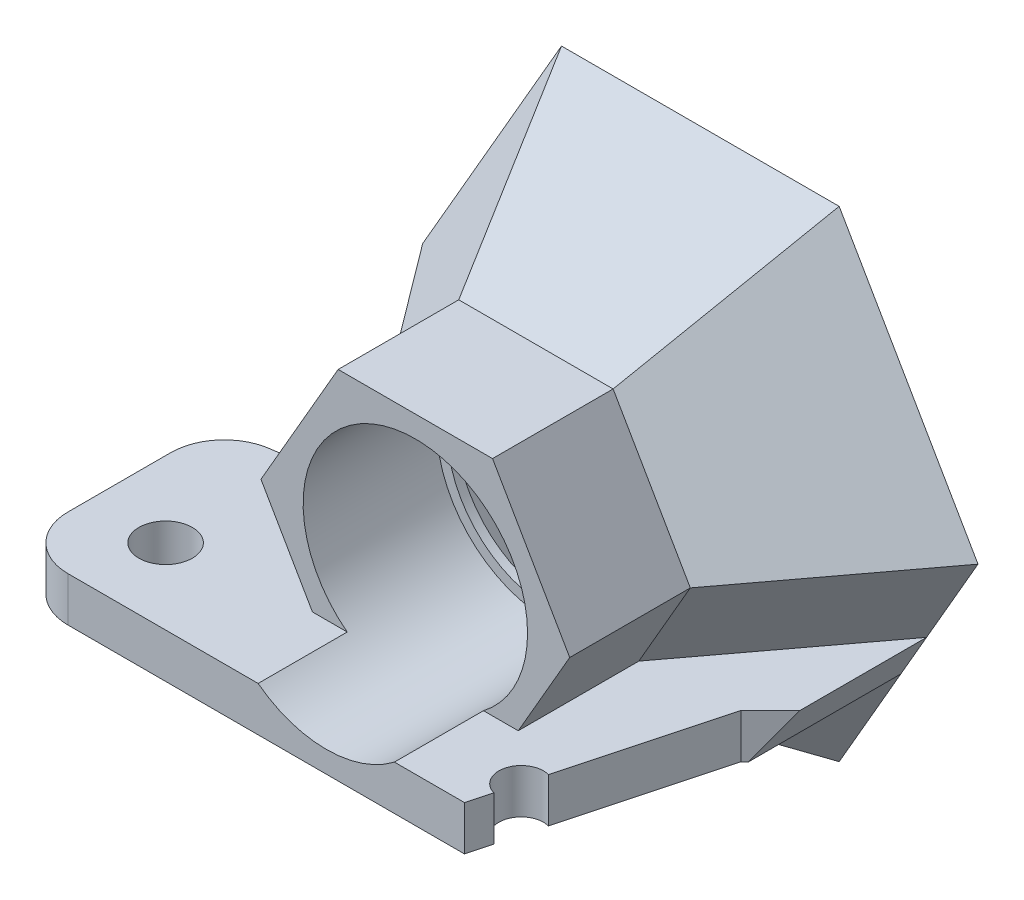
ISO-10303-21;
HEADER;
FILE_DESCRIPTION(('STEP AP214'),'2;1');
FILE_NAME('part.step','',(''),(''),'','','');
FILE_SCHEMA(('AUTOMOTIVE_DESIGN { 1 0 10303 214 1 1 1 1 }'));
ENDSEC;
DATA;
#1=APPLICATION_CONTEXT('core data for automotive mechanical design processes');
#2=APPLICATION_PROTOCOL_DEFINITION('international standard','automotive_design',2000,#1);
#3=PRODUCT_CONTEXT('',#1,'mechanical');
#4=PRODUCT('Part','Part','',(#3));
#5=PRODUCT_RELATED_PRODUCT_CATEGORY('part','',(#4));
#6=PRODUCT_DEFINITION_FORMATION('','',#4);
#7=PRODUCT_DEFINITION_CONTEXT('part definition',#1,'design');
#8=PRODUCT_DEFINITION('design','',#6,#7);
#9=PRODUCT_DEFINITION_SHAPE('','',#8);
#10=(LENGTH_UNIT() NAMED_UNIT(*) SI_UNIT(.MILLI.,.METRE.));
#11=(NAMED_UNIT(*) PLANE_ANGLE_UNIT() SI_UNIT($,.RADIAN.));
#12=(NAMED_UNIT(*) SI_UNIT($,.STERADIAN.) SOLID_ANGLE_UNIT());
#13=UNCERTAINTY_MEASURE_WITH_UNIT(LENGTH_MEASURE(1.E-05),#10,'distance_accuracy_value','');
#14=(GEOMETRIC_REPRESENTATION_CONTEXT(3) GLOBAL_UNCERTAINTY_ASSIGNED_CONTEXT((#13)) GLOBAL_UNIT_ASSIGNED_CONTEXT((#10,
#11,#12)) REPRESENTATION_CONTEXT('',''));
#15=CARTESIAN_POINT('',(0.,0.,0.));
#16=DIRECTION('',(0.,0.,1.));
#17=DIRECTION('',(1.,0.,0.));
#18=AXIS2_PLACEMENT_3D('',#15,#16,#17);
#19=CARTESIAN_POINT('',(7.75,-15.0059240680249,21.0347770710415));
#20=DIRECTION('',(-0.965925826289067,0.,-0.258819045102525));
#21=DIRECTION('',(-0.258819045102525,0.,0.965925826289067));
#22=AXIS2_PLACEMENT_3D('',#19,#20,#21);
#23=PLANE('',#22);
#24=DIRECTION('',(0.258819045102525,0.,-0.965925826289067));
#25=VECTOR('',#24,1.);
#26=CARTESIAN_POINT('',(125012.199250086,-7.50592406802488,-466501.920996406));
#27=LINE('',#26,#25);
#28=CARTESIAN_POINT('',(7.75931848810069,-7.50592406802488,21.));
#29=VERTEX_POINT('',#28);
#30=CARTESIAN_POINT('',(8.10822628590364,-7.50592406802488,19.697858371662));
#31=VERTEX_POINT('',#30);
#32=EDGE_CURVE('E289',#29,#31,#27,.T.);
#33=ORIENTED_EDGE('',*,*,#32,.T.);
#34=DIRECTION('',(0.,1.,0.));
#35=VECTOR('',#34,1.);
#36=CARTESIAN_POINT('',(8.10822628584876,-15.0059240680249,19.6978583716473));
#37=LINE('',#36,#35);
#38=CARTESIAN_POINT('',(8.10822628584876,-5.00592406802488,19.6978583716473));
#39=VERTEX_POINT('',#38);
#40=EDGE_CURVE('E273',#31,#39,#37,.T.);
#41=ORIENTED_EDGE('',*,*,#40,.T.);
#42=DIRECTION('',(-0.258819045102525,0.,0.965925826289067));
#43=VECTOR('',#42,1.);
#44=CARTESIAN_POINT('',(7.75,-5.00592406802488,21.0347770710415));
#45=LINE('',#44,#43);
#46=CARTESIAN_POINT('',(7.75931848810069,-5.00592406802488,21.));
#47=VERTEX_POINT('',#46);
#48=EDGE_CURVE('E286',#39,#47,#45,.T.);
#49=ORIENTED_EDGE('',*,*,#48,.T.);
#50=DIRECTION('',(0.,-1.,0.));
#51=VECTOR('',#50,1.);
#52=CARTESIAN_POINT('',(7.75931848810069,0.,21.));
#53=LINE('',#52,#51);
#54=EDGE_CURVE('E363',#47,#29,#53,.T.);
#55=ORIENTED_EDGE('',*,*,#54,.T.);
#56=EDGE_LOOP('',(#33,#41,#49,#55));
#57=FACE_BOUND('',#56,.T.);
#58=ADVANCED_FACE('F47',(#57),#23,.F.);
#59=CARTESIAN_POINT('',(11.2549099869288,-7.50592406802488,-500000.));
#60=DIRECTION('',(0.866025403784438,-0.500000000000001,0.));
#61=DIRECTION('',(0.500000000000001,0.866025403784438,0.));
#62=AXIS2_PLACEMENT_3D('',#59,#60,#61);
#63=PLANE('',#62);
#64=DIRECTION('',(0.447213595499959,0.774596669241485,-0.447213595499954));
#65=VECTOR('',#64,1.);
#66=CARTESIAN_POINT('',(100012.964832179,173200.536504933,-99993.1603112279));
#67=LINE('',#66,#65);
#68=CARTESIAN_POINT('',(11.2549099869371,-7.50592406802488,8.54961096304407));
#69=VERTEX_POINT('',#68);
#70=CARTESIAN_POINT('',(12.6982856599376,-5.00592406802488,7.1062352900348));
#71=VERTEX_POINT('',#70);
#72=EDGE_CURVE('E309',#69,#71,#67,.T.);
#73=ORIENTED_EDGE('',*,*,#72,.F.);
#74=DIRECTION('',(0.,0.,1.));
#75=VECTOR('',#74,1.);
#76=CARTESIAN_POINT('',(11.2549099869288,-7.50592406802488,-500000.));
#77=LINE('',#76,#75);
#78=CARTESIAN_POINT('',(11.2549099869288,-7.50592406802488,5.6843418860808E-11));
#79=VERTEX_POINT('',#78);
#80=EDGE_CURVE('E424',#79,#69,#77,.T.);
#81=ORIENTED_EDGE('',*,*,#80,.F.);
#82=DIRECTION('',(-0.500000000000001,-0.866025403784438,0.));
#83=VECTOR('',#82,1.);
#84=CARTESIAN_POINT('',(11.2549099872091,-7.50592406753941,5.6843418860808E-11));
#85=LINE('',#84,#83);
#86=CARTESIAN_POINT('',(12.6982856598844,-5.00592406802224,1.70530256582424E-10));
#87=VERTEX_POINT('',#86);
#88=EDGE_CURVE('E418',#79,#87,#85,.F.);
#89=ORIENTED_EDGE('',*,*,#88,.T.);
#90=DIRECTION('',(0.,0.,1.));
#91=VECTOR('',#90,1.);
#92=CARTESIAN_POINT('',(12.6982856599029,-5.00592406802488,-500000.));
#93=LINE('',#92,#91);
#94=EDGE_CURVE('E421',#87,#71,#93,.T.);
#95=ORIENTED_EDGE('',*,*,#94,.T.);
#96=EDGE_LOOP('',(#73,#81,#89,#95));
#97=FACE_BOUND('',#96,.T.);
#98=ADVANCED_FACE('F343',(#97),#63,.T.);
#99=CARTESIAN_POINT('',(-11.2549099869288,-7.50592406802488,-500000.));
#100=DIRECTION('',(-0.866025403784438,-0.500000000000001,0.));
#101=DIRECTION('',(0.500000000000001,-0.866025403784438,0.));
#102=AXIS2_PLACEMENT_3D('',#99,#100,#101);
#103=PLANE('',#102);
#104=DIRECTION('',(0.,0.,1.));
#105=VECTOR('',#104,1.);
#106=CARTESIAN_POINT('',(-11.2549099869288,-7.50592406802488,-500000.));
#107=LINE('',#106,#105);
#108=CARTESIAN_POINT('',(-11.2549099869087,-7.50592406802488,5.6843418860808E-11));
#109=VERTEX_POINT('',#108);
#110=CARTESIAN_POINT('',(-11.2549099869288,-7.50592406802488,7.23006751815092));
#111=VERTEX_POINT('',#110);
#112=EDGE_CURVE('E409',#109,#111,#107,.T.);
#113=ORIENTED_EDGE('',*,*,#112,.T.);
#114=DIRECTION('',(-0.500000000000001,0.866025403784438,0.));
#115=VECTOR('',#114,1.);
#116=CARTESIAN_POINT('',(-11.2549099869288,-7.50592406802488,7.23006751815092));
#117=LINE('',#116,#115);
#118=CARTESIAN_POINT('',(-12.6982856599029,-5.00592406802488,7.23006751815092));
#119=VERTEX_POINT('',#118);
#120=EDGE_CURVE('E595',#111,#119,#117,.T.);
#121=ORIENTED_EDGE('',*,*,#120,.T.);
#122=DIRECTION('',(0.,0.,1.));
#123=VECTOR('',#122,1.);
#124=CARTESIAN_POINT('',(-12.6982856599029,-5.00592406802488,-500000.));
#125=LINE('',#124,#123);
#126=CARTESIAN_POINT('',(-12.6982856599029,-5.00592406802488,5.6843418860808E-11));
#127=VERTEX_POINT('',#126);
#128=EDGE_CURVE('E403',#127,#119,#125,.T.);
#129=ORIENTED_EDGE('',*,*,#128,.F.);
#130=DIRECTION('',(-0.500000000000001,0.866025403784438,0.));
#131=VECTOR('',#130,1.);
#132=CARTESIAN_POINT('',(-11.2549099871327,-7.50592406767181,5.6843418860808E-11));
#133=LINE('',#132,#131);
#134=EDGE_CURVE('E402',#127,#109,#133,.F.);
#135=ORIENTED_EDGE('',*,*,#134,.T.);
#136=EDGE_LOOP('',(#113,#121,#129,#135));
#137=FACE_BOUND('',#136,.T.);
#138=ADVANCED_FACE('F337',(#137),#103,.T.);
#139=CARTESIAN_POINT('',(-15.5884572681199,0.,0.));
#140=DIRECTION('',(-0.72631001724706,-0.419335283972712,0.544639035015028));
#141=DIRECTION('',(0.599934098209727,0.,0.800049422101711));
#142=AXIS2_PLACEMENT_3D('',#139,#140,#141);
#143=PLANE('',#142);
#144=DIRECTION('',(-0.299967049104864,-0.519558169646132,-0.800049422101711));
#145=VECTOR('',#144,1.);
#146=CARTESIAN_POINT('',(-7.79422863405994,-13.5,0.));
#147=LINE('',#146,#145);
#148=CARTESIAN_POINT('',(-4.33354728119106,-7.50592406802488,9.23006751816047));
#149=VERTEX_POINT('',#148);
#150=CARTESIAN_POINT('',(-7.79422863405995,-13.5,0.));
#151=VERTEX_POINT('',#150);
#152=EDGE_CURVE('E554',#149,#151,#147,.T.);
#153=ORIENTED_EDGE('',*,*,#152,.F.);
#154=DIRECTION('',(-0.599934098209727,0.,-0.800049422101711));
#155=VECTOR('',#154,1.);
#156=CARTESIAN_POINT('',(-239997.228052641,-7.50592406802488,-320036.216808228));
#157=LINE('',#156,#155);
#158=EDGE_CURVE('E400',#109,#149,#157,.F.);
#159=ORIENTED_EDGE('',*,*,#158,.F.);
#160=DIRECTION('',(0.5,-0.866025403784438,0.));
#161=VECTOR('',#160,1.);
#162=CARTESIAN_POINT('',(-15.5884572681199,0.,0.));
#163=LINE('',#162,#161);
#164=EDGE_CURVE('E534',#109,#151,#163,.T.);
#165=ORIENTED_EDGE('',*,*,#164,.T.);
#166=EDGE_LOOP('',(#153,#159,#165));
#167=FACE_BOUND('',#166,.T.);
#168=ADVANCED_FACE('F342',(#167),#143,.T.);
#169=CARTESIAN_POINT('',(7.79422863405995,-13.5,0.));
#170=DIRECTION('',(0.72631001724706,-0.419335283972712,0.544639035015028));
#171=DIRECTION('',(0.599934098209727,0.,-0.800049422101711));
#172=AXIS2_PLACEMENT_3D('',#169,#170,#171);
#173=PLANE('',#172);
#174=DIRECTION('',(-0.5,-0.866025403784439,0.));
#175=VECTOR('',#174,1.);
#176=CARTESIAN_POINT('',(4.33354728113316,-7.50592406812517,9.23006751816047));
#177=LINE('',#176,#175);
#178=CARTESIAN_POINT('',(5.77692295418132,-5.00592406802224,9.23006751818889));
#179=VERTEX_POINT('',#178);
#180=CARTESIAN_POINT('',(8.66709456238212,0.,9.23006751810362));
#181=VERTEX_POINT('',#180);
#182=EDGE_CURVE('E463',#179,#181,#177,.F.);
#183=ORIENTED_EDGE('',*,*,#182,.F.);
#184=DIRECTION('',(0.599934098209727,0.,-0.800049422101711));
#185=VECTOR('',#184,1.);
#186=CARTESIAN_POINT('',(240001.162571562,-5.0059240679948,-320039.538902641));
#187=LINE('',#186,#185);
#188=EDGE_CURVE('E427',#87,#179,#187,.F.);
#189=ORIENTED_EDGE('',*,*,#188,.F.);
#190=DIRECTION('',(0.5,0.866025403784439,0.));
#191=VECTOR('',#190,1.);
#192=CARTESIAN_POINT('',(7.79422863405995,-13.5,0.));
#193=LINE('',#192,#191);
#194=CARTESIAN_POINT('',(15.5884572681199,0.,0.));
#195=VERTEX_POINT('',#194);
#196=EDGE_CURVE('E541',#87,#195,#193,.T.);
#197=ORIENTED_EDGE('',*,*,#196,.T.);
#198=DIRECTION('',(0.599934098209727,0.,-0.800049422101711));
#199=VECTOR('',#198,1.);
#200=CARTESIAN_POINT('',(15.5884572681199,0.,0.));
#201=LINE('',#200,#199);
#202=EDGE_CURVE('E545',#181,#195,#201,.T.);
#203=ORIENTED_EDGE('',*,*,#202,.F.);
#204=EDGE_LOOP('',(#183,#189,#197,#203));
#205=FACE_BOUND('',#204,.T.);
#206=ADVANCED_FACE('F641',(#205),#173,.T.);
#207=CARTESIAN_POINT('',(15.5884572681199,0.,0.));
#208=DIRECTION('',(0.72631001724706,0.419335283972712,0.544639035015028));
#209=DIRECTION('',(0.599934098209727,0.,-0.800049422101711));
#210=AXIS2_PLACEMENT_3D('',#207,#208,#209);
#211=PLANE('',#210);
#212=DIRECTION('',(0.299967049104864,0.519558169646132,-0.800049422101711));
#213=VECTOR('',#212,1.);
#214=CARTESIAN_POINT('',(7.79422863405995,13.5,0.));
#215=LINE('',#214,#213);
#216=CARTESIAN_POINT('',(4.33354728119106,7.50592406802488,9.23006751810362));
#217=VERTEX_POINT('',#216);
#218=CARTESIAN_POINT('',(7.79422863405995,13.5,0.));
#219=VERTEX_POINT('',#218);
#220=EDGE_CURVE('E546',#217,#219,#215,.T.);
#221=ORIENTED_EDGE('',*,*,#220,.F.);
#222=DIRECTION('',(0.5,-0.866025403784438,0.));
#223=VECTOR('',#222,1.);
#224=CARTESIAN_POINT('',(8.66709456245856,-1.32398094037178E-10,9.23006751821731));
#225=LINE('',#224,#223);
#226=EDGE_CURVE('E466',#181,#217,#225,.F.);
#227=ORIENTED_EDGE('',*,*,#226,.F.);
#228=ORIENTED_EDGE('',*,*,#202,.T.);
#229=DIRECTION('',(-0.5,0.866025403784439,0.));
#230=VECTOR('',#229,1.);
#231=CARTESIAN_POINT('',(15.5884572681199,0.,0.));
#232=LINE('',#231,#230);
#233=EDGE_CURVE('E498',#195,#219,#232,.T.);
#234=ORIENTED_EDGE('',*,*,#233,.T.);
#235=EDGE_LOOP('',(#221,#227,#228,#234));
#236=FACE_BOUND('',#235,.T.);
#237=ADVANCED_FACE('F636',(#236),#211,.T.);
#238=CARTESIAN_POINT('',(7.79422863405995,13.5,0.));
#239=DIRECTION('',(0.,0.838670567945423,0.544639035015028));
#240=DIRECTION('',(0.,-0.544639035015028,0.838670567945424));
#241=AXIS2_PLACEMENT_3D('',#238,#239,#240);
#242=PLANE('',#241);
#243=DIRECTION('',(-0.299967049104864,0.519558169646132,-0.800049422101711));
#244=VECTOR('',#243,1.);
#245=CARTESIAN_POINT('',(-7.79422863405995,13.5,0.));
#246=LINE('',#245,#244);
#247=CARTESIAN_POINT('',(-4.33354728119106,7.50592406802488,9.23006751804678));
#248=VERTEX_POINT('',#247);
#249=CARTESIAN_POINT('',(-7.79422863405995,13.5,0.));
#250=VERTEX_POINT('',#249);
#251=EDGE_CURVE('E549',#248,#250,#246,.T.);
#252=ORIENTED_EDGE('',*,*,#251,.F.);
#253=DIRECTION('',(1.,0.,0.));
#254=VECTOR('',#253,1.);
#255=CARTESIAN_POINT('',(4.33354728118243,7.50592406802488,9.23006751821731));
#256=LINE('',#255,#254);
#257=EDGE_CURVE('E476',#217,#248,#256,.F.);
#258=ORIENTED_EDGE('',*,*,#257,.F.);
#259=ORIENTED_EDGE('',*,*,#220,.T.);
#260=DIRECTION('',(-1.,0.,0.));
#261=VECTOR('',#260,1.);
#262=CARTESIAN_POINT('',(7.79422863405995,13.5,0.));
#263=LINE('',#262,#261);
#264=EDGE_CURVE('E528',#219,#250,#263,.T.);
#265=ORIENTED_EDGE('',*,*,#264,.T.);
#266=EDGE_LOOP('',(#252,#258,#259,#265));
#267=FACE_BOUND('',#266,.T.);
#268=ADVANCED_FACE('F49',(#267),#242,.T.);
#269=CARTESIAN_POINT('',(-7.79422863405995,13.5,0.));
#270=DIRECTION('',(-0.72631001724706,0.419335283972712,0.544639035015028));
#271=DIRECTION('',(0.599934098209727,0.,0.800049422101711));
#272=AXIS2_PLACEMENT_3D('',#269,#270,#271);
#273=PLANE('',#272);
#274=DIRECTION('',(-0.599934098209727,0.,-0.800049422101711));
#275=VECTOR('',#274,1.);
#276=CARTESIAN_POINT('',(-15.5884572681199,0.,0.));
#277=LINE('',#276,#275);
#278=CARTESIAN_POINT('',(-8.66709456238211,0.,9.23006751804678));
#279=VERTEX_POINT('',#278);
#280=CARTESIAN_POINT('',(-15.5884572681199,0.,0.));
#281=VERTEX_POINT('',#280);
#282=EDGE_CURVE('E557',#279,#281,#277,.T.);
#283=ORIENTED_EDGE('',*,*,#282,.F.);
#284=DIRECTION('',(0.5,0.866025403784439,0.));
#285=VECTOR('',#284,1.);
#286=CARTESIAN_POINT('',(-4.33354728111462,7.50592406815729,9.23006751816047));
#287=LINE('',#286,#285);
#288=EDGE_CURVE('E474',#248,#279,#287,.F.);
#289=ORIENTED_EDGE('',*,*,#288,.F.);
#290=ORIENTED_EDGE('',*,*,#251,.T.);
#291=DIRECTION('',(-0.5,-0.866025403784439,0.));
#292=VECTOR('',#291,1.);
#293=CARTESIAN_POINT('',(-7.79422863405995,13.5,0.));
#294=LINE('',#293,#292);
#295=EDGE_CURVE('E531',#250,#281,#294,.T.);
#296=ORIENTED_EDGE('',*,*,#295,.T.);
#297=EDGE_LOOP('',(#283,#289,#290,#296));
#298=FACE_BOUND('',#297,.T.);
#299=ADVANCED_FACE('F629',(#298),#273,.T.);
#300=EDGE_CURVE('E535',#281,#127,#163,.T.);
#301=ORIENTED_EDGE('',*,*,#300,.T.);
#302=DIRECTION('',(0.599934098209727,0.,0.800049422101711));
#303=VECTOR('',#302,1.);
#304=CARTESIAN_POINT('',(-240001.162571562,-5.0059240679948,-320039.538902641));
#305=LINE('',#304,#303);
#306=CARTESIAN_POINT('',(-5.77692295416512,-5.00592406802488,9.23006751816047));
#307=VERTEX_POINT('',#306);
#308=EDGE_CURVE('E404',#307,#127,#305,.F.);
#309=ORIENTED_EDGE('',*,*,#308,.F.);
#310=DIRECTION('',(-0.5,0.866025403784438,0.));
#311=VECTOR('',#310,1.);
#312=CARTESIAN_POINT('',(-8.66709456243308,8.82728235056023E-11,9.23006751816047));
#313=LINE('',#312,#311);
#314=EDGE_CURVE('E470',#279,#307,#313,.F.);
#315=ORIENTED_EDGE('',*,*,#314,.F.);
#316=ORIENTED_EDGE('',*,*,#282,.T.);
#317=EDGE_LOOP('',(#301,#309,#315,#316));
#318=FACE_BOUND('',#317,.T.);
#319=ADVANCED_FACE('F624',(#318),#143,.T.);
#320=CARTESIAN_POINT('',(-7.79422863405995,-13.5,0.));
#321=DIRECTION('',(0.,-0.838670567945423,0.544639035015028));
#322=DIRECTION('',(0.,-0.544639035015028,-0.838670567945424));
#323=AXIS2_PLACEMENT_3D('',#320,#321,#322);
#324=PLANE('',#323);
#325=DIRECTION('',(0.299967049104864,-0.519558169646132,-0.800049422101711));
#326=VECTOR('',#325,1.);
#327=CARTESIAN_POINT('',(7.79422863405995,-13.5,0.));
#328=LINE('',#327,#326);
#329=CARTESIAN_POINT('',(4.33354728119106,-7.50592406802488,9.23006751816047));
#330=VERTEX_POINT('',#329);
#331=CARTESIAN_POINT('',(7.79422863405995,-13.5,0.));
#332=VERTEX_POINT('',#331);
#333=EDGE_CURVE('E552',#330,#332,#328,.T.);
#334=ORIENTED_EDGE('',*,*,#333,.F.);
#335=DIRECTION('',(-1.,0.,0.));
#336=VECTOR('',#335,1.);
#337=CARTESIAN_POINT('',(-4.33354728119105,-7.50592406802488,9.23006751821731));
#338=LINE('',#337,#336);
#339=EDGE_CURVE('E467',#149,#330,#338,.F.);
#340=ORIENTED_EDGE('',*,*,#339,.F.);
#341=ORIENTED_EDGE('',*,*,#152,.T.);
#342=DIRECTION('',(1.,0.,0.));
#343=VECTOR('',#342,1.);
#344=CARTESIAN_POINT('',(-7.79422863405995,-13.5,0.));
#345=LINE('',#344,#343);
#346=EDGE_CURVE('E538',#151,#332,#345,.T.);
#347=ORIENTED_EDGE('',*,*,#346,.T.);
#348=EDGE_LOOP('',(#334,#340,#341,#347));
#349=FACE_BOUND('',#348,.T.);
#350=ADVANCED_FACE('F653',(#349),#324,.T.);
#351=EDGE_CURVE('E542',#332,#79,#193,.T.);
#352=ORIENTED_EDGE('',*,*,#351,.T.);
#353=DIRECTION('',(-0.599934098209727,0.,0.800049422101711));
#354=VECTOR('',#353,1.);
#355=CARTESIAN_POINT('',(239997.228052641,-7.50592406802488,-320036.216808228));
#356=LINE('',#355,#354);
#357=EDGE_CURVE('E415',#330,#79,#356,.F.);
#358=ORIENTED_EDGE('',*,*,#357,.F.);
#359=ORIENTED_EDGE('',*,*,#333,.T.);
#360=EDGE_LOOP('',(#352,#358,#359));
#361=FACE_BOUND('',#360,.T.);
#362=ADVANCED_FACE('F649',(#361),#173,.T.);
#363=CARTESIAN_POINT('',(0.,27.,0.));
#364=DIRECTION('',(0.,0.,1.));
#365=DIRECTION('',(1.,0.,0.));
#366=AXIS2_PLACEMENT_3D('',#363,#364,#365);
#367=PLANE('',#366);
#368=DIRECTION('',(-1.,0.,0.));
#369=VECTOR('',#368,1.);
#370=CARTESIAN_POINT('',(6.41740609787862,-12.4726626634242,0.));
#371=LINE('',#370,#369);
#372=CARTESIAN_POINT('',(-7.20109514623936,-12.4726626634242,0.));
#373=VERTEX_POINT('',#372);
#374=CARTESIAN_POINT('',(7.20109514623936,-12.4726626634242,0.));
#375=VERTEX_POINT('',#374);
#376=EDGE_CURVE('E567',#373,#375,#371,.F.);
#377=ORIENTED_EDGE('',*,*,#376,.T.);
#378=DIRECTION('',(-0.5,-0.866025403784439,0.));
#379=VECTOR('',#378,1.);
#380=CARTESIAN_POINT('',(14.0103457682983,-0.678694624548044,0.));
#381=LINE('',#380,#379);
#382=CARTESIAN_POINT('',(14.4021902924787,0.,0.));
#383=VERTEX_POINT('',#382);
#384=EDGE_CURVE('E569',#375,#383,#381,.F.);
#385=ORIENTED_EDGE('',*,*,#384,.T.);
#386=DIRECTION('',(0.5,-0.866025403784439,0.));
#387=VECTOR('',#386,1.);
#388=CARTESIAN_POINT('',(7.59293967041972,11.7939680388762,0.));
#389=LINE('',#388,#387);
#390=CARTESIAN_POINT('',(7.20109514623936,12.4726626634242,0.));
#391=VERTEX_POINT('',#390);
#392=EDGE_CURVE('E548',#383,#391,#389,.F.);
#393=ORIENTED_EDGE('',*,*,#392,.T.);
#394=DIRECTION('',(1.,0.,0.));
#395=VECTOR('',#394,1.);
#396=CARTESIAN_POINT('',(-6.41740609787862,12.4726626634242,0.));
#397=LINE('',#396,#395);
#398=CARTESIAN_POINT('',(-7.20109514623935,12.4726626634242,0.));
#399=VERTEX_POINT('',#398);
#400=EDGE_CURVE('E561',#391,#399,#397,.F.);
#401=ORIENTED_EDGE('',*,*,#400,.T.);
#402=DIRECTION('',(0.5,0.866025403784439,0.));
#403=VECTOR('',#402,1.);
#404=CARTESIAN_POINT('',(-14.0103457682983,0.678694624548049,0.));
#405=LINE('',#404,#403);
#406=CARTESIAN_POINT('',(-14.4021902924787,0.,0.));
#407=VERTEX_POINT('',#406);
#408=EDGE_CURVE('E563',#399,#407,#405,.F.);
#409=ORIENTED_EDGE('',*,*,#408,.T.);
#410=DIRECTION('',(-0.5,0.866025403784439,0.));
#411=VECTOR('',#410,1.);
#412=CARTESIAN_POINT('',(-7.59293967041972,-11.7939680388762,0.));
#413=LINE('',#412,#411);
#414=EDGE_CURVE('E565',#407,#373,#413,.F.);
#415=ORIENTED_EDGE('',*,*,#414,.T.);
#416=EDGE_LOOP('',(#377,#385,#393,#401,#409,#415));
#417=FACE_BOUND('',#416,.T.);
#418=ORIENTED_EDGE('',*,*,#233,.F.);
#419=ORIENTED_EDGE('',*,*,#196,.F.);
#420=ORIENTED_EDGE('',*,*,#88,.F.);
#421=ORIENTED_EDGE('',*,*,#351,.F.);
#422=ORIENTED_EDGE('',*,*,#346,.F.);
#423=ORIENTED_EDGE('',*,*,#164,.F.);
#424=ORIENTED_EDGE('',*,*,#134,.F.);
#425=ORIENTED_EDGE('',*,*,#300,.F.);
#426=ORIENTED_EDGE('',*,*,#295,.F.);
#427=ORIENTED_EDGE('',*,*,#264,.F.);
#428=EDGE_LOOP('',(#418,#419,#420,#421,#422,#423,#424,#425,#426,#427));
#429=FACE_BOUND('',#428,.T.);
#430=ADVANCED_FACE('F619',(#417,#429),#367,.F.);
#431=CARTESIAN_POINT('',(14.1358372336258,-0.838670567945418,-1.08927807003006));
#432=DIRECTION('',(0.72631001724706,0.419335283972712,0.544639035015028));
#433=DIRECTION('',(0.599934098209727,0.,-0.800049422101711));
#434=AXIS2_PLACEMENT_3D('',#431,#432,#433);
#435=PLANE('',#434);
#436=DIRECTION('',(0.299967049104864,0.519558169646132,-0.800049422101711));
#437=VECTOR('',#436,1.);
#438=CARTESIAN_POINT('',(6.91295333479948,11.9735864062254,-1.32168610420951));
#439=LINE('',#438,#437);
#440=CARTESIAN_POINT('',(3.41792090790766,5.92001266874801,8.));
#441=VERTEX_POINT('',#440);
#442=CARTESIAN_POINT('',(5.99057845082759,10.3759862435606,1.13840241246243));
#443=VERTEX_POINT('',#442);
#444=EDGE_CURVE('E495',#441,#443,#439,.T.);
#445=ORIENTED_EDGE('',*,*,#444,.T.);
#446=DIRECTION('',(-0.5,0.866025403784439,0.));
#447=VECTOR('',#446,1.);
#448=CARTESIAN_POINT('',(12.1945707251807,-0.369643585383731,1.13840241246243));
#449=LINE('',#448,#447);
#450=CARTESIAN_POINT('',(11.9811569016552,0.,1.13840241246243));
#451=VERTEX_POINT('',#450);
#452=EDGE_CURVE('E583',#443,#451,#449,.F.);
#453=ORIENTED_EDGE('',*,*,#452,.T.);
#454=DIRECTION('',(0.599934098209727,0.,-0.800049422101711));
#455=VECTOR('',#454,1.);
#456=CARTESIAN_POINT('',(13.825906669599,0.,-1.32168610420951));
#457=LINE('',#456,#455);
#458=CARTESIAN_POINT('',(6.83584181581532,0.,8.));
#459=VERTEX_POINT('',#458);
#460=EDGE_CURVE('E503',#459,#451,#457,.T.);
#461=ORIENTED_EDGE('',*,*,#460,.F.);
#462=DIRECTION('',(0.5,-0.866025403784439,0.));
#463=VECTOR('',#462,1.);
#464=CARTESIAN_POINT('',(9.02399567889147,-3.78999366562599,8.));
#465=LINE('',#464,#463);
#466=EDGE_CURVE('E494',#459,#441,#465,.F.);
#467=ORIENTED_EDGE('',*,*,#466,.T.);
#468=EDGE_LOOP('',(#445,#453,#461,#467));
#469=FACE_BOUND('',#468,.T.);
#470=ADVANCED_FACE('F747',(#469),#435,.F.);
#471=CARTESIAN_POINT('',(7.79422863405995,11.8226588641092,-1.08927807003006));
#472=DIRECTION('',(0.,0.838670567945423,0.544639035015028));
#473=DIRECTION('',(0.,-0.544639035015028,0.838670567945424));
#474=AXIS2_PLACEMENT_3D('',#471,#472,#473);
#475=PLANE('',#474);
#476=DIRECTION('',(-0.299967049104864,0.519558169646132,-0.800049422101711));
#477=VECTOR('',#476,1.);
#478=CARTESIAN_POINT('',(-6.91295333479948,11.9735864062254,-1.32168610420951));
#479=LINE('',#478,#477);
#480=CARTESIAN_POINT('',(-3.41792090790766,5.92001266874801,8.));
#481=VERTEX_POINT('',#480);
#482=CARTESIAN_POINT('',(-5.99057845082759,10.3759862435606,1.13840241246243));
#483=VERTEX_POINT('',#482);
#484=EDGE_CURVE('E499',#481,#483,#479,.T.);
#485=ORIENTED_EDGE('',*,*,#484,.T.);
#486=DIRECTION('',(-1.,0.,0.));
#487=VECTOR('',#486,1.);
#488=CARTESIAN_POINT('',(6.41740609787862,10.3759862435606,1.13840241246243));
#489=LINE('',#488,#487);
#490=EDGE_CURVE('E581',#483,#443,#489,.F.);
#491=ORIENTED_EDGE('',*,*,#490,.T.);
#492=ORIENTED_EDGE('',*,*,#444,.F.);
#493=DIRECTION('',(1.,0.,0.));
#494=VECTOR('',#493,1.);
#495=CARTESIAN_POINT('',(7.79422863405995,5.92001266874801,8.));
#496=LINE('',#495,#494);
#497=EDGE_CURVE('E502',#441,#481,#496,.F.);
#498=ORIENTED_EDGE('',*,*,#497,.T.);
#499=EDGE_LOOP('',(#485,#491,#492,#498));
#500=FACE_BOUND('',#499,.T.);
#501=ADVANCED_FACE('F750',(#500),#475,.F.);
#502=CARTESIAN_POINT('',(-6.34160859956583,12.6613294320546,-1.08927807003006));
#503=DIRECTION('',(-0.72631001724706,0.419335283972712,0.544639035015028));
#504=DIRECTION('',(0.599934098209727,0.,0.800049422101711));
#505=AXIS2_PLACEMENT_3D('',#502,#503,#504);
#506=PLANE('',#505);
#507=DIRECTION('',(-0.599934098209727,0.,-0.800049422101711));
#508=VECTOR('',#507,1.);
#509=CARTESIAN_POINT('',(-13.825906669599,0.,-1.32168610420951));
#510=LINE('',#509,#508);
#511=CARTESIAN_POINT('',(-6.83584181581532,0.,8.));
#512=VERTEX_POINT('',#511);
#513=CARTESIAN_POINT('',(-11.9811569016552,0.,1.13840241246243));
#514=VERTEX_POINT('',#513);
#515=EDGE_CURVE('E510',#512,#514,#510,.T.);
#516=ORIENTED_EDGE('',*,*,#515,.T.);
#517=DIRECTION('',(-0.5,-0.866025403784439,0.));
#518=VECTOR('',#517,1.);
#519=CARTESIAN_POINT('',(-5.77716462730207,10.7456298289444,1.13840241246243));
#520=LINE('',#519,#518);
#521=EDGE_CURVE('E579',#514,#483,#520,.F.);
#522=ORIENTED_EDGE('',*,*,#521,.T.);
#523=ORIENTED_EDGE('',*,*,#484,.F.);
#524=DIRECTION('',(0.5,0.866025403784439,0.));
#525=VECTOR('',#524,1.);
#526=CARTESIAN_POINT('',(-1.22976704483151,9.71000633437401,8.));
#527=LINE('',#526,#525);
#528=EDGE_CURVE('E512',#481,#512,#527,.F.);
#529=ORIENTED_EDGE('',*,*,#528,.T.);
#530=EDGE_LOOP('',(#516,#522,#523,#529));
#531=FACE_BOUND('',#530,.T.);
#532=ADVANCED_FACE('F754',(#531),#506,.F.);
#533=CARTESIAN_POINT('',(-14.1358372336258,0.838670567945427,-1.08927807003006));
#534=DIRECTION('',(-0.72631001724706,-0.419335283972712,0.544639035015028));
#535=DIRECTION('',(0.599934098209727,0.,0.800049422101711));
#536=AXIS2_PLACEMENT_3D('',#533,#534,#535);
#537=PLANE('',#536);
#538=DIRECTION('',(-0.299967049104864,-0.519558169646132,-0.800049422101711));
#539=VECTOR('',#538,1.);
#540=CARTESIAN_POINT('',(-6.91295333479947,-11.9735864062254,-1.32168610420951));
#541=LINE('',#540,#539);
#542=CARTESIAN_POINT('',(-3.41792090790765,-5.92001266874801,8.));
#543=VERTEX_POINT('',#542);
#544=CARTESIAN_POINT('',(-5.99057845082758,-10.3759862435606,1.13840241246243));
#545=VERTEX_POINT('',#544);
#546=EDGE_CURVE('E515',#543,#545,#541,.T.);
#547=ORIENTED_EDGE('',*,*,#546,.T.);
#548=DIRECTION('',(0.5,-0.866025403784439,0.));
#549=VECTOR('',#548,1.);
#550=CARTESIAN_POINT('',(-12.1945707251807,0.369643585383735,1.13840241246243));
#551=LINE('',#550,#549);
#552=EDGE_CURVE('E577',#545,#514,#551,.F.);
#553=ORIENTED_EDGE('',*,*,#552,.T.);
#554=ORIENTED_EDGE('',*,*,#515,.F.);
#555=DIRECTION('',(-0.5,0.866025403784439,0.));
#556=VECTOR('',#555,1.);
#557=CARTESIAN_POINT('',(-9.02399567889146,3.789993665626,8.));
#558=LINE('',#557,#556);
#559=EDGE_CURVE('E517',#512,#543,#558,.F.);
#560=ORIENTED_EDGE('',*,*,#559,.T.);
#561=EDGE_LOOP('',(#547,#553,#554,#560));
#562=FACE_BOUND('',#561,.T.);
#563=ADVANCED_FACE('F758',(#562),#537,.F.);
#564=CARTESIAN_POINT('',(-7.79422863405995,-11.8226588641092,-1.08927807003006));
#565=DIRECTION('',(0.,-0.838670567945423,0.544639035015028));
#566=DIRECTION('',(0.,-0.544639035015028,-0.838670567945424));
#567=AXIS2_PLACEMENT_3D('',#564,#565,#566);
#568=PLANE('',#567);
#569=DIRECTION('',(0.299967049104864,-0.519558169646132,-0.800049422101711));
#570=VECTOR('',#569,1.);
#571=CARTESIAN_POINT('',(6.91295333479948,-11.9735864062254,-1.32168610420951));
#572=LINE('',#571,#570);
#573=CARTESIAN_POINT('',(3.41792090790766,-5.92001266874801,8.));
#574=VERTEX_POINT('',#573);
#575=CARTESIAN_POINT('',(5.99057845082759,-10.3759862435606,1.13840241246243));
#576=VERTEX_POINT('',#575);
#577=EDGE_CURVE('E506',#574,#576,#572,.T.);
#578=ORIENTED_EDGE('',*,*,#577,.T.);
#579=DIRECTION('',(1.,0.,0.));
#580=VECTOR('',#579,1.);
#581=CARTESIAN_POINT('',(-6.41740609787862,-10.3759862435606,1.13840241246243));
#582=LINE('',#581,#580);
#583=EDGE_CURVE('E575',#576,#545,#582,.F.);
#584=ORIENTED_EDGE('',*,*,#583,.T.);
#585=ORIENTED_EDGE('',*,*,#546,.F.);
#586=DIRECTION('',(-1.,0.,0.));
#587=VECTOR('',#586,1.);
#588=CARTESIAN_POINT('',(-7.79422863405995,-5.92001266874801,8.));
#589=LINE('',#588,#587);
#590=EDGE_CURVE('E521',#543,#574,#589,.F.);
#591=ORIENTED_EDGE('',*,*,#590,.T.);
#592=EDGE_LOOP('',(#578,#584,#585,#591));
#593=FACE_BOUND('',#592,.T.);
#594=ADVANCED_FACE('F762',(#593),#568,.F.);
#595=CARTESIAN_POINT('',(6.34160859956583,-12.6613294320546,-1.08927807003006));
#596=DIRECTION('',(0.72631001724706,-0.419335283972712,0.544639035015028));
#597=DIRECTION('',(0.599934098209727,0.,-0.800049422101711));
#598=AXIS2_PLACEMENT_3D('',#595,#596,#597);
#599=PLANE('',#598);
#600=ORIENTED_EDGE('',*,*,#460,.T.);
#601=DIRECTION('',(0.5,0.866025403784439,0.));
#602=VECTOR('',#601,1.);
#603=CARTESIAN_POINT('',(5.77716462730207,-10.7456298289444,1.13840241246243));
#604=LINE('',#603,#602);
#605=EDGE_CURVE('E572',#451,#576,#604,.F.);
#606=ORIENTED_EDGE('',*,*,#605,.T.);
#607=ORIENTED_EDGE('',*,*,#577,.F.);
#608=DIRECTION('',(-0.5,-0.866025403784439,0.));
#609=VECTOR('',#608,1.);
#610=CARTESIAN_POINT('',(1.22976704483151,-9.710006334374,8.));
#611=LINE('',#610,#609);
#612=EDGE_CURVE('E507',#574,#459,#611,.F.);
#613=ORIENTED_EDGE('',*,*,#612,.T.);
#614=EDGE_LOOP('',(#600,#606,#607,#613));
#615=FACE_BOUND('',#614,.T.);
#616=ADVANCED_FACE('F766',(#615),#599,.F.);
#617=CARTESIAN_POINT('',(0.,27.,8.));
#618=DIRECTION('',(0.,0.,1.));
#619=DIRECTION('',(1.,0.,0.));
#620=AXIS2_PLACEMENT_3D('',#617,#618,#619);
#621=PLANE('',#620);
#622=CARTESIAN_POINT('',(0.,0.,8.));
#623=DIRECTION('',(0.,0.,1.));
#624=DIRECTION('',(1.,0.,0.));
#625=AXIS2_PLACEMENT_3D('',#622,#623,#624);
#626=CIRCLE('',#625,5.7);
#627=CARTESIAN_POINT('',(5.7,0.,8.));
#628=VERTEX_POINT('',#627);
#629=EDGE_CURVE('E488',#628,#628,#626,.T.);
#630=ORIENTED_EDGE('',*,*,#629,.T.);
#631=EDGE_LOOP('',(#630));
#632=FACE_BOUND('',#631,.T.);
#633=ORIENTED_EDGE('',*,*,#466,.F.);
#634=ORIENTED_EDGE('',*,*,#612,.F.);
#635=ORIENTED_EDGE('',*,*,#590,.F.);
#636=ORIENTED_EDGE('',*,*,#559,.F.);
#637=ORIENTED_EDGE('',*,*,#528,.F.);
#638=ORIENTED_EDGE('',*,*,#497,.F.);
#639=EDGE_LOOP('',(#633,#634,#635,#636,#637,#638));
#640=FACE_BOUND('',#639,.T.);
#641=ADVANCED_FACE('F745',(#632,#640),#621,.F.);
#642=CARTESIAN_POINT('',(0.,0.,8.5));
#643=DIRECTION('',(0.,0.,1.));
#644=DIRECTION('',(1.,0.,0.));
#645=AXIS2_PLACEMENT_3D('',#642,#643,#644);
#646=CYLINDRICAL_SURFACE('',#645,6.3);
#647=DIRECTION('',(0.,0.,1.));
#648=VECTOR('',#647,1.);
#649=CARTESIAN_POINT('',(3.82501297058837,-5.00592406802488,9.23006751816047));
#650=LINE('',#649,#648);
#651=CARTESIAN_POINT('',(3.82501297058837,-5.00592406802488,16.));
#652=VERTEX_POINT('',#651);
#653=CARTESIAN_POINT('',(3.82501297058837,-5.00592406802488,21.));
#654=VERTEX_POINT('',#653);
#655=EDGE_CURVE('E383',#652,#654,#650,.T.);
#656=ORIENTED_EDGE('',*,*,#655,.F.);
#657=CARTESIAN_POINT('',(0.,0.,16.));
#658=DIRECTION('',(0.,0.,1.));
#659=DIRECTION('',(1.,0.,0.));
#660=AXIS2_PLACEMENT_3D('',#657,#658,#659);
#661=CIRCLE('',#660,6.3);
#662=CARTESIAN_POINT('',(-3.82501297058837,-5.00592406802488,16.));
#663=VERTEX_POINT('',#662);
#664=EDGE_CURVE('E445',#652,#663,#661,.T.);
#665=ORIENTED_EDGE('',*,*,#664,.T.);
#666=DIRECTION('',(0.,0.,1.));
#667=VECTOR('',#666,1.);
#668=CARTESIAN_POINT('',(-3.82501297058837,-5.00592406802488,9.23006751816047));
#669=LINE('',#668,#667);
#670=CARTESIAN_POINT('',(-3.82501297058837,-5.00592406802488,21.));
#671=VERTEX_POINT('',#670);
#672=EDGE_CURVE('E393',#663,#671,#669,.T.);
#673=ORIENTED_EDGE('',*,*,#672,.T.);
#674=CARTESIAN_POINT('',(0.,0.,21.));
#675=DIRECTION('',(0.,0.,-1.));
#676=DIRECTION('',(1.,0.,0.));
#677=AXIS2_PLACEMENT_3D('',#674,#675,#676);
#678=CIRCLE('',#677,6.30000000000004);
#679=EDGE_CURVE('E385',#654,#671,#678,.T.);
#680=ORIENTED_EDGE('',*,*,#679,.F.);
#681=EDGE_LOOP('',(#656,#665,#673,#680));
#682=FACE_BOUND('',#681,.T.);
#683=CARTESIAN_POINT('',(0.,0.,8.5));
#684=DIRECTION('',(0.,0.,1.));
#685=DIRECTION('',(1.,0.,0.));
#686=AXIS2_PLACEMENT_3D('',#683,#684,#685);
#687=CIRCLE('',#686,6.3);
#688=CARTESIAN_POINT('',(6.3,0.,8.5));
#689=VERTEX_POINT('',#688);
#690=EDGE_CURVE('E491',#689,#689,#687,.T.);
#691=ORIENTED_EDGE('',*,*,#690,.F.);
#692=EDGE_LOOP('',(#691));
#693=FACE_BOUND('',#692,.T.);
#694=ADVANCED_FACE('F741',(#682,#693),#646,.F.);
#695=CARTESIAN_POINT('',(0.,0.,8.5));
#696=DIRECTION('',(0.,0.,1.));
#697=DIRECTION('',(1.,0.,0.));
#698=AXIS2_PLACEMENT_3D('',#695,#696,#697);
#699=PLANE('',#698);
#700=CARTESIAN_POINT('',(0.,0.,8.5));
#701=DIRECTION('',(0.,0.,1.));
#702=DIRECTION('',(1.,0.,0.));
#703=AXIS2_PLACEMENT_3D('',#700,#701,#702);
#704=CIRCLE('',#703,5.7);
#705=CARTESIAN_POINT('',(5.7,0.,8.5));
#706=VERTEX_POINT('',#705);
#707=EDGE_CURVE('E465',#706,#706,#704,.T.);
#708=ORIENTED_EDGE('',*,*,#707,.F.);
#709=EDGE_LOOP('',(#708));
#710=FACE_BOUND('',#709,.T.);
#711=ORIENTED_EDGE('',*,*,#690,.T.);
#712=EDGE_LOOP('',(#711));
#713=FACE_BOUND('',#712,.T.);
#714=ADVANCED_FACE('F737',(#710,#713),#699,.T.);
#715=CARTESIAN_POINT('',(0.,0.,0.));
#716=DIRECTION('',(0.,0.,1.));
#717=DIRECTION('',(1.,0.,0.));
#718=AXIS2_PLACEMENT_3D('',#715,#716,#717);
#719=CYLINDRICAL_SURFACE('',#718,5.7);
#720=ORIENTED_EDGE('',*,*,#707,.T.);
#721=EDGE_LOOP('',(#720));
#722=FACE_BOUND('',#721,.T.);
#723=ORIENTED_EDGE('',*,*,#629,.F.);
#724=EDGE_LOOP('',(#723));
#725=FACE_BOUND('',#724,.T.);
#726=ADVANCED_FACE('F716',(#722,#725),#719,.F.);
#727=CARTESIAN_POINT('',(-4.33354728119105,-7.50592406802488,-500000.));
#728=DIRECTION('',(0.,-1.,0.));
#729=DIRECTION('',(0.,0.,-1.));
#730=AXIS2_PLACEMENT_3D('',#727,#728,#729);
#731=PLANE('',#730);
#732=DIRECTION('',(1.,0.,0.));
#733=VECTOR('',#732,1.);
#734=CARTESIAN_POINT('',(-17.5,-7.50592406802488,21.));
#735=LINE('',#734,#733);
#736=CARTESIAN_POINT('',(-14.5,-7.50592406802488,21.));
#737=VERTEX_POINT('',#736);
#738=EDGE_CURVE('E372',#737,#29,#735,.T.);
#739=ORIENTED_EDGE('',*,*,#738,.F.);
#740=CARTESIAN_POINT('',(-14.5,-7.50592406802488,18.));
#741=DIRECTION('',(0.,-1.,0.));
#742=DIRECTION('',(0.,0.,-1.));
#743=AXIS2_PLACEMENT_3D('',#740,#741,#742);
#744=CIRCLE('',#743,3.);
#745=CARTESIAN_POINT('',(-17.5,-7.50592406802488,18.));
#746=VERTEX_POINT('',#745);
#747=EDGE_CURVE('E69',#737,#746,#744,.T.);
#748=ORIENTED_EDGE('',*,*,#747,.T.);
#749=DIRECTION('',(0.,0.,1.));
#750=VECTOR('',#749,1.);
#751=CARTESIAN_POINT('',(-17.5,-7.50592406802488,9.23006751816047));
#752=LINE('',#751,#750);
#753=CARTESIAN_POINT('',(-17.5,-7.50592406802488,12.2300675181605));
#754=VERTEX_POINT('',#753);
#755=EDGE_CURVE('E388',#754,#746,#752,.T.);
#756=ORIENTED_EDGE('',*,*,#755,.F.);
#757=CARTESIAN_POINT('',(-14.5,-7.50592406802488,12.2300675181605));
#758=DIRECTION('',(0.,-1.,0.));
#759=DIRECTION('',(0.,0.,-1.));
#760=AXIS2_PLACEMENT_3D('',#757,#758,#759);
#761=CIRCLE('',#760,3.);
#762=CARTESIAN_POINT('',(-14.5,-7.50592406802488,9.23006751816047));
#763=VERTEX_POINT('',#762);
#764=EDGE_CURVE('E588',#754,#763,#761,.T.);
#765=ORIENTED_EDGE('',*,*,#764,.T.);
#766=DIRECTION('',(1.,0.,0.));
#767=VECTOR('',#766,1.);
#768=CARTESIAN_POINT('',(-17.5,-7.50592406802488,9.23006751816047));
#769=LINE('',#768,#767);
#770=CARTESIAN_POINT('',(-13.5643110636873,-7.50592406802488,9.23006751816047));
#771=VERTEX_POINT('',#770);
#772=EDGE_CURVE('E380',#763,#771,#769,.T.);
#773=ORIENTED_EDGE('',*,*,#772,.T.);
#774=CARTESIAN_POINT('',(-13.5643110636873,-7.50592406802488,7.23006751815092));
#775=DIRECTION('',(0.,-1.,0.));
#776=DIRECTION('',(-1.,0.,0.));
#777=AXIS2_PLACEMENT_3D('',#774,#775,#776);
#778=ELLIPSE('',#777,2.3094010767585,2.);
#779=EDGE_CURVE('E359',#771,#111,#778,.F.);
#780=ORIENTED_EDGE('',*,*,#779,.T.);
#781=ORIENTED_EDGE('',*,*,#112,.F.);
#782=ORIENTED_EDGE('',*,*,#158,.T.);
#783=ORIENTED_EDGE('',*,*,#339,.T.);
#784=ORIENTED_EDGE('',*,*,#357,.T.);
#785=ORIENTED_EDGE('',*,*,#80,.T.);
#786=DIRECTION('',(0.707106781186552,0.,-0.707106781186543));
#787=VECTOR('',#786,1.);
#788=CARTESIAN_POINT('',(250007.735486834,-7.50592406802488,-249987.930965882));
#789=LINE('',#788,#787);
#790=CARTESIAN_POINT('',(11.0370018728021,-7.50592406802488,8.76751907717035));
#791=VERTEX_POINT('',#790);
#792=EDGE_CURVE('E307',#791,#69,#789,.T.);
#793=ORIENTED_EDGE('',*,*,#792,.F.);
#794=CARTESIAN_POINT('',(8.75527389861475,-7.50592406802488,17.28304380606));
#795=VERTEX_POINT('',#794);
#796=EDGE_CURVE('E305',#795,#791,#27,.T.);
#797=ORIENTED_EDGE('',*,*,#796,.F.);
#798=CARTESIAN_POINT('',(8.43175009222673,-7.50592406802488,18.4904510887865));
#799=DIRECTION('',(0.,-1.,0.));
#800=DIRECTION('',(0.,0.,-1.));
#801=AXIS2_PLACEMENT_3D('',#798,#799,#800);
#802=CIRCLE('',#801,1.24999999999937);
#803=EDGE_CURVE('E281',#31,#795,#802,.T.);
#804=ORIENTED_EDGE('',*,*,#803,.F.);
#805=ORIENTED_EDGE('',*,*,#32,.F.);
#806=EDGE_LOOP('',(#739,#748,#756,#765,#773,#780,#781,#782,#783,#784,#785,#793,#797,#804,#805));
#807=FACE_BOUND('',#806,.T.);
#808=CARTESIAN_POINT('',(-13.2604040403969,-7.50592406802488,16.7604040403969));
#809=DIRECTION('',(0.,-1.,0.));
#810=DIRECTION('',(0.,0.,-1.));
#811=AXIS2_PLACEMENT_3D('',#808,#809,#810);
#812=CIRCLE('',#811,1.49999999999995);
#813=CARTESIAN_POINT('',(-13.2604040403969,-7.50592406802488,15.260404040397));
#814=VERTEX_POINT('',#813);
#815=EDGE_CURVE('E314',#814,#814,#812,.T.);
#816=ORIENTED_EDGE('',*,*,#815,.F.);
#817=EDGE_LOOP('',(#816));
#818=FACE_BOUND('',#817,.T.);
#819=ADVANCED_FACE('F378',(#807,#818),#731,.T.);
#820=CARTESIAN_POINT('',(-8.66709456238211,0.,-500000.));
#821=DIRECTION('',(-0.866025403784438,-0.5,0.));
#822=DIRECTION('',(0.5,-0.866025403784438,0.));
#823=AXIS2_PLACEMENT_3D('',#820,#821,#822);
#824=PLANE('',#823);
#825=DIRECTION('',(0.,0.,1.));
#826=VECTOR('',#825,1.);
#827=CARTESIAN_POINT('',(-5.77692295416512,-5.00592406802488,-500000.));
#828=LINE('',#827,#826);
#829=CARTESIAN_POINT('',(-5.77692295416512,-5.00592406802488,16.));
#830=VERTEX_POINT('',#829);
#831=EDGE_CURVE('E399',#307,#830,#828,.T.);
#832=ORIENTED_EDGE('',*,*,#831,.T.);
#833=DIRECTION('',(0.5,-0.866025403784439,0.));
#834=VECTOR('',#833,1.);
#835=CARTESIAN_POINT('',(-8.66709456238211,0.,16.));
#836=LINE('',#835,#834);
#837=CARTESIAN_POINT('',(-8.66709456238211,0.,16.));
#838=VERTEX_POINT('',#837);
#839=EDGE_CURVE('E459',#838,#830,#836,.T.);
#840=ORIENTED_EDGE('',*,*,#839,.F.);
#841=DIRECTION('',(0.,0.,1.));
#842=VECTOR('',#841,1.);
#843=CARTESIAN_POINT('',(-8.66709456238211,0.,-500000.));
#844=LINE('',#843,#842);
#845=EDGE_CURVE('E462',#279,#838,#844,.T.);
#846=ORIENTED_EDGE('',*,*,#845,.F.);
#847=ORIENTED_EDGE('',*,*,#314,.T.);
#848=EDGE_LOOP('',(#832,#840,#846,#847));
#849=FACE_BOUND('',#848,.T.);
#850=ADVANCED_FACE('F715',(#849),#824,.T.);
#851=CARTESIAN_POINT('',(-4.33354728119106,7.50592406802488,-500000.));
#852=DIRECTION('',(-0.866025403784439,0.5,0.));
#853=DIRECTION('',(-0.5,-0.866025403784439,0.));
#854=AXIS2_PLACEMENT_3D('',#851,#852,#853);
#855=PLANE('',#854);
#856=DIRECTION('',(0.,0.,1.));
#857=VECTOR('',#856,1.);
#858=CARTESIAN_POINT('',(-4.33354728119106,7.50592406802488,-500000.));
#859=LINE('',#858,#857);
#860=CARTESIAN_POINT('',(-4.33354728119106,7.50592406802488,16.));
#861=VERTEX_POINT('',#860);
#862=EDGE_CURVE('E480',#248,#861,#859,.T.);
#863=ORIENTED_EDGE('',*,*,#862,.F.);
#864=ORIENTED_EDGE('',*,*,#288,.T.);
#865=ORIENTED_EDGE('',*,*,#845,.T.);
#866=DIRECTION('',(-0.5,-0.866025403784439,0.));
#867=VECTOR('',#866,1.);
#868=CARTESIAN_POINT('',(-4.33354728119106,7.50592406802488,16.));
#869=LINE('',#868,#867);
#870=EDGE_CURVE('E456',#861,#838,#869,.T.);
#871=ORIENTED_EDGE('',*,*,#870,.F.);
#872=EDGE_LOOP('',(#863,#864,#865,#871));
#873=FACE_BOUND('',#872,.T.);
#874=ADVANCED_FACE('F719',(#873),#855,.T.);
#875=CARTESIAN_POINT('',(4.33354728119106,7.50592406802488,-500000.));
#876=DIRECTION('',(0.,1.,0.));
#877=DIRECTION('',(-1.,0.,0.));
#878=AXIS2_PLACEMENT_3D('',#875,#876,#877);
#879=PLANE('',#878);
#880=DIRECTION('',(0.,0.,1.));
#881=VECTOR('',#880,1.);
#882=CARTESIAN_POINT('',(4.33354728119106,7.50592406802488,-500000.));
#883=LINE('',#882,#881);
#884=CARTESIAN_POINT('',(4.33354728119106,7.50592406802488,16.));
#885=VERTEX_POINT('',#884);
#886=EDGE_CURVE('E482',#217,#885,#883,.T.);
#887=ORIENTED_EDGE('',*,*,#886,.F.);
#888=ORIENTED_EDGE('',*,*,#257,.T.);
#889=ORIENTED_EDGE('',*,*,#862,.T.);
#890=DIRECTION('',(-1.,0.,0.));
#891=VECTOR('',#890,1.);
#892=CARTESIAN_POINT('',(4.33354728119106,7.50592406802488,16.));
#893=LINE('',#892,#891);
#894=EDGE_CURVE('E453',#885,#861,#893,.T.);
#895=ORIENTED_EDGE('',*,*,#894,.F.);
#896=EDGE_LOOP('',(#887,#888,#889,#895));
#897=FACE_BOUND('',#896,.T.);
#898=ADVANCED_FACE('F723',(#897),#879,.T.);
#899=CARTESIAN_POINT('',(8.66709456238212,0.,-500000.));
#900=DIRECTION('',(0.866025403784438,0.5,0.));
#901=DIRECTION('',(-0.5,0.866025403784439,0.));
#902=AXIS2_PLACEMENT_3D('',#899,#900,#901);
#903=PLANE('',#902);
#904=DIRECTION('',(0.,0.,1.));
#905=VECTOR('',#904,1.);
#906=CARTESIAN_POINT('',(8.66709456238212,0.,-500000.));
#907=LINE('',#906,#905);
#908=CARTESIAN_POINT('',(8.66709456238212,0.,16.));
#909=VERTEX_POINT('',#908);
#910=EDGE_CURVE('E471',#181,#909,#907,.T.);
#911=ORIENTED_EDGE('',*,*,#910,.F.);
#912=ORIENTED_EDGE('',*,*,#226,.T.);
#913=ORIENTED_EDGE('',*,*,#886,.T.);
#914=DIRECTION('',(-0.5,0.866025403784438,0.));
#915=VECTOR('',#914,1.);
#916=CARTESIAN_POINT('',(8.66709456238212,0.,16.));
#917=LINE('',#916,#915);
#918=EDGE_CURVE('E450',#909,#885,#917,.T.);
#919=ORIENTED_EDGE('',*,*,#918,.F.);
#920=EDGE_LOOP('',(#911,#912,#913,#919));
#921=FACE_BOUND('',#920,.T.);
#922=ADVANCED_FACE('F727',(#921),#903,.T.);
#923=CARTESIAN_POINT('',(4.33354728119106,-7.50592406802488,-500000.));
#924=DIRECTION('',(0.866025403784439,-0.5,0.));
#925=DIRECTION('',(0.5,0.866025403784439,0.));
#926=AXIS2_PLACEMENT_3D('',#923,#924,#925);
#927=PLANE('',#926);
#928=DIRECTION('',(0.,0.,1.));
#929=VECTOR('',#928,1.);
#930=CARTESIAN_POINT('',(5.77692295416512,-5.00592406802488,-500000.));
#931=LINE('',#930,#929);
#932=CARTESIAN_POINT('',(5.77692295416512,-5.00592406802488,16.));
#933=VERTEX_POINT('',#932);
#934=EDGE_CURVE('E406',#179,#933,#931,.T.);
#935=ORIENTED_EDGE('',*,*,#934,.F.);
#936=ORIENTED_EDGE('',*,*,#182,.T.);
#937=ORIENTED_EDGE('',*,*,#910,.T.);
#938=DIRECTION('',(0.5,0.866025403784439,0.));
#939=VECTOR('',#938,1.);
#940=CARTESIAN_POINT('',(4.33354728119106,-7.50592406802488,16.));
#941=LINE('',#940,#939);
#942=EDGE_CURVE('E448',#933,#909,#941,.T.);
#943=ORIENTED_EDGE('',*,*,#942,.F.);
#944=EDGE_LOOP('',(#935,#936,#937,#943));
#945=FACE_BOUND('',#944,.T.);
#946=ADVANCED_FACE('F711',(#945),#927,.T.);
#947=CARTESIAN_POINT('',(8.66709456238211,0.,16.));
#948=DIRECTION('',(0.,0.,1.));
#949=DIRECTION('',(1.,0.,0.));
#950=AXIS2_PLACEMENT_3D('',#947,#948,#949);
#951=PLANE('',#950);
#952=DIRECTION('',(-1.,0.,0.));
#953=VECTOR('',#952,1.);
#954=CARTESIAN_POINT('',(8.66709456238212,-5.00592406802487,16.));
#955=LINE('',#954,#953);
#956=EDGE_CURVE('E390',#663,#830,#955,.T.);
#957=ORIENTED_EDGE('',*,*,#956,.F.);
#958=ORIENTED_EDGE('',*,*,#664,.F.);
#959=DIRECTION('',(-1.,0.,0.));
#960=VECTOR('',#959,1.);
#961=CARTESIAN_POINT('',(8.66709456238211,-5.00592406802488,16.));
#962=LINE('',#961,#960);
#963=EDGE_CURVE('E397',#933,#652,#962,.T.);
#964=ORIENTED_EDGE('',*,*,#963,.F.);
#965=ORIENTED_EDGE('',*,*,#942,.T.);
#966=ORIENTED_EDGE('',*,*,#918,.T.);
#967=ORIENTED_EDGE('',*,*,#894,.T.);
#968=ORIENTED_EDGE('',*,*,#870,.T.);
#969=ORIENTED_EDGE('',*,*,#839,.T.);
#970=EDGE_LOOP('',(#957,#958,#964,#965,#966,#967,#968,#969));
#971=FACE_BOUND('',#970,.T.);
#972=ADVANCED_FACE('F707',(#971),#951,.T.);
#973=CARTESIAN_POINT('',(0.889700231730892,26.4863313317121,2.5));
#974=DIRECTION('',(-0.5,-0.866025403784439,0.));
#975=DIRECTION('',(0.866025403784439,-0.5,0.));
#976=AXIS2_PLACEMENT_3D('',#973,#974,#975);
#977=CYLINDRICAL_SURFACE('',#976,2.5);
#978=CARTESIAN_POINT('',(-7.20109514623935,12.4726626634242,2.5));
#979=DIRECTION('',(-0.866025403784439,-0.5,0.));
#980=DIRECTION('',(0.5,-0.866025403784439,0.));
#981=AXIS2_PLACEMENT_3D('',#978,#979,#980);
#982=ELLIPSE('',#981,2.88675134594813,2.5);
#983=EDGE_CURVE('E439',#483,#399,#982,.F.);
#984=ORIENTED_EDGE('',*,*,#983,.F.);
#985=ORIENTED_EDGE('',*,*,#521,.F.);
#986=CARTESIAN_POINT('',(-14.4021902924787,0.,2.5));
#987=DIRECTION('',(0.,-1.,0.));
#988=DIRECTION('',(1.,0.,0.));
#989=AXIS2_PLACEMENT_3D('',#986,#987,#988);
#990=ELLIPSE('',#989,2.88675134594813,2.5);
#991=EDGE_CURVE('E442',#407,#514,#990,.T.);
#992=ORIENTED_EDGE('',*,*,#991,.F.);
#993=ORIENTED_EDGE('',*,*,#408,.F.);
#994=EDGE_LOOP('',(#984,#985,#992,#993));
#995=FACE_BOUND('',#994,.T.);
#996=ADVANCED_FACE('F703',(#995),#977,.T.);
#997=CARTESIAN_POINT('',(-22.492985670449,14.0136686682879,2.5));
#998=DIRECTION('',(0.5,-0.866025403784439,0.));
#999=DIRECTION('',(0.866025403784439,0.5,0.));
#1000=AXIS2_PLACEMENT_3D('',#997,#998,#999);
#1001=CYLINDRICAL_SURFACE('',#1000,2.5);
#1002=ORIENTED_EDGE('',*,*,#991,.T.);
#1003=ORIENTED_EDGE('',*,*,#552,.F.);
#1004=CARTESIAN_POINT('',(-7.20109514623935,-12.4726626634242,2.5));
#1005=DIRECTION('',(0.866025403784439,-0.5,0.));
#1006=DIRECTION('',(0.5,0.866025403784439,0.));
#1007=AXIS2_PLACEMENT_3D('',#1004,#1005,#1006);
#1008=ELLIPSE('',#1007,2.88675134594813,2.5);
#1009=EDGE_CURVE('E436',#373,#545,#1008,.T.);
#1010=ORIENTED_EDGE('',*,*,#1009,.F.);
#1011=ORIENTED_EDGE('',*,*,#414,.F.);
#1012=EDGE_LOOP('',(#1002,#1003,#1010,#1011));
#1013=FACE_BOUND('',#1012,.T.);
#1014=ADVANCED_FACE('F699',(#1013),#1001,.T.);
#1015=CARTESIAN_POINT('',(0.,12.4726626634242,2.5));
#1016=DIRECTION('',(-1.,0.,0.));
#1017=DIRECTION('',(0.,-1.,0.));
#1018=AXIS2_PLACEMENT_3D('',#1015,#1016,#1017);
#1019=CYLINDRICAL_SURFACE('',#1018,2.5);
#1020=ORIENTED_EDGE('',*,*,#983,.T.);
#1021=ORIENTED_EDGE('',*,*,#400,.F.);
#1022=CARTESIAN_POINT('',(7.20109514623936,12.4726626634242,2.5));
#1023=DIRECTION('',(-0.866025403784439,0.5,0.));
#1024=DIRECTION('',(-0.5,-0.866025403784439,0.));
#1025=AXIS2_PLACEMENT_3D('',#1022,#1023,#1024);
#1026=ELLIPSE('',#1025,2.88675134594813,2.5);
#1027=EDGE_CURVE('E433',#443,#391,#1026,.F.);
#1028=ORIENTED_EDGE('',*,*,#1027,.F.);
#1029=ORIENTED_EDGE('',*,*,#490,.F.);
#1030=EDGE_LOOP('',(#1020,#1021,#1028,#1029));
#1031=FACE_BOUND('',#1030,.T.);
#1032=ADVANCED_FACE('F695',(#1031),#1019,.T.);
#1033=CARTESIAN_POINT('',(0.,-12.4726626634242,2.5));
#1034=DIRECTION('',(1.,0.,0.));
#1035=DIRECTION('',(0.,0.,-1.));
#1036=AXIS2_PLACEMENT_3D('',#1033,#1034,#1035);
#1037=CYLINDRICAL_SURFACE('',#1036,2.5);
#1038=ORIENTED_EDGE('',*,*,#1009,.T.);
#1039=ORIENTED_EDGE('',*,*,#583,.F.);
#1040=CARTESIAN_POINT('',(7.20109514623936,-12.4726626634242,2.5));
#1041=DIRECTION('',(0.866025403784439,0.5,0.));
#1042=DIRECTION('',(-0.5,0.866025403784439,0.));
#1043=AXIS2_PLACEMENT_3D('',#1040,#1041,#1042);
#1044=ELLIPSE('',#1043,2.88675134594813,2.5);
#1045=EDGE_CURVE('E431',#375,#576,#1044,.T.);
#1046=ORIENTED_EDGE('',*,*,#1045,.F.);
#1047=ORIENTED_EDGE('',*,*,#376,.F.);
#1048=EDGE_LOOP('',(#1038,#1039,#1046,#1047));
#1049=FACE_BOUND('',#1048,.T.);
#1050=ADVANCED_FACE('F691',(#1049),#1037,.T.);
#1051=CARTESIAN_POINT('',(-0.889700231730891,26.4863313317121,2.5));
#1052=DIRECTION('',(-0.5,0.866025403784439,0.));
#1053=DIRECTION('',(-0.866025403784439,-0.5,0.));
#1054=AXIS2_PLACEMENT_3D('',#1051,#1052,#1053);
#1055=CYLINDRICAL_SURFACE('',#1054,2.5);
#1056=ORIENTED_EDGE('',*,*,#1027,.T.);
#1057=ORIENTED_EDGE('',*,*,#392,.F.);
#1058=CARTESIAN_POINT('',(14.4021902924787,0.,2.5));
#1059=DIRECTION('',(0.,1.,0.));
#1060=DIRECTION('',(1.,0.,0.));
#1061=AXIS2_PLACEMENT_3D('',#1058,#1059,#1060);
#1062=ELLIPSE('',#1061,2.88675134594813,2.5);
#1063=EDGE_CURVE('E417',#451,#383,#1062,.F.);
#1064=ORIENTED_EDGE('',*,*,#1063,.F.);
#1065=ORIENTED_EDGE('',*,*,#452,.F.);
#1066=EDGE_LOOP('',(#1056,#1057,#1064,#1065));
#1067=FACE_BOUND('',#1066,.T.);
#1068=ADVANCED_FACE('F687',(#1067),#1055,.T.);
#1069=CARTESIAN_POINT('',(22.492985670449,14.0136686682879,2.5));
#1070=DIRECTION('',(0.5,0.866025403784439,0.));
#1071=DIRECTION('',(-0.866025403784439,0.5,0.));
#1072=AXIS2_PLACEMENT_3D('',#1069,#1070,#1071);
#1073=CYLINDRICAL_SURFACE('',#1072,2.5);
#1074=ORIENTED_EDGE('',*,*,#1045,.T.);
#1075=ORIENTED_EDGE('',*,*,#605,.F.);
#1076=ORIENTED_EDGE('',*,*,#1063,.T.);
#1077=ORIENTED_EDGE('',*,*,#384,.F.);
#1078=EDGE_LOOP('',(#1074,#1075,#1076,#1077));
#1079=FACE_BOUND('',#1078,.T.);
#1080=ADVANCED_FACE('F684',(#1079),#1073,.T.);
#1081=CARTESIAN_POINT('',(12.6982856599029,-5.00592406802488,-500000.));
#1082=DIRECTION('',(0.,1.,0.));
#1083=DIRECTION('',(-1.,0.,0.));
#1084=AXIS2_PLACEMENT_3D('',#1081,#1082,#1083);
#1085=PLANE('',#1084);
#1086=CARTESIAN_POINT('',(8.43175009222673,-5.00592406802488,18.4904510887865));
#1087=DIRECTION('',(0.,1.,0.));
#1088=DIRECTION('',(-1.,0.,0.));
#1089=AXIS2_PLACEMENT_3D('',#1086,#1087,#1088);
#1090=CIRCLE('',#1089,1.24999999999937);
#1091=CARTESIAN_POINT('',(8.75527389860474,-5.00592406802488,17.2830438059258));
#1092=VERTEX_POINT('',#1091);
#1093=EDGE_CURVE('E270',#1092,#39,#1090,.T.);
#1094=ORIENTED_EDGE('',*,*,#1093,.F.);
#1095=CARTESIAN_POINT('',(11.0370018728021,-5.00592406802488,8.76751907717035));
#1096=VERTEX_POINT('',#1095);
#1097=EDGE_CURVE('E296',#1096,#1092,#45,.T.);
#1098=ORIENTED_EDGE('',*,*,#1097,.F.);
#1099=DIRECTION('',(-0.707106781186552,0.,0.707106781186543));
#1100=VECTOR('',#1099,1.);
#1101=CARTESIAN_POINT('',(11.0370018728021,-5.00592406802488,8.76751907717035));
#1102=LINE('',#1101,#1100);
#1103=EDGE_CURVE('E297',#71,#1096,#1102,.T.);
#1104=ORIENTED_EDGE('',*,*,#1103,.F.);
#1105=ORIENTED_EDGE('',*,*,#94,.F.);
#1106=ORIENTED_EDGE('',*,*,#188,.T.);
#1107=ORIENTED_EDGE('',*,*,#934,.T.);
#1108=ORIENTED_EDGE('',*,*,#963,.T.);
#1109=ORIENTED_EDGE('',*,*,#655,.T.);
#1110=DIRECTION('',(-1.,0.,0.));
#1111=VECTOR('',#1110,1.);
#1112=CARTESIAN_POINT('',(17.5,-5.00592406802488,21.));
#1113=LINE('',#1112,#1111);
#1114=EDGE_CURVE('E295',#47,#654,#1113,.T.);
#1115=ORIENTED_EDGE('',*,*,#1114,.F.);
#1116=ORIENTED_EDGE('',*,*,#48,.F.);
#1117=EDGE_LOOP('',(#1094,#1098,#1104,#1105,#1106,#1107,#1108,#1109,#1115,#1116));
#1118=FACE_BOUND('',#1117,.T.);
#1119=ADVANCED_FACE('F293',(#1118),#1085,.T.);
#1120=CARTESIAN_POINT('',(-12.6982856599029,-5.00592406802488,-500000.));
#1121=DIRECTION('',(0.,1.,0.));
#1122=DIRECTION('',(-1.,0.,0.));
#1123=AXIS2_PLACEMENT_3D('',#1120,#1121,#1122);
#1124=PLANE('',#1123);
#1125=CARTESIAN_POINT('',(-13.2604040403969,-5.00592406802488,16.7604040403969));
#1126=DIRECTION('',(0.,1.,0.));
#1127=DIRECTION('',(1.,0.,0.));
#1128=AXIS2_PLACEMENT_3D('',#1125,#1126,#1127);
#1129=CIRCLE('',#1128,1.49999999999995);
#1130=CARTESIAN_POINT('',(-11.7604040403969,-5.00592406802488,16.7604040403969));
#1131=VERTEX_POINT('',#1130);
#1132=EDGE_CURVE('E311',#1131,#1131,#1129,.T.);
#1133=ORIENTED_EDGE('',*,*,#1132,.F.);
#1134=EDGE_LOOP('',(#1133));
#1135=FACE_BOUND('',#1134,.T.);
#1136=DIRECTION('',(0.,0.,1.));
#1137=VECTOR('',#1136,1.);
#1138=CARTESIAN_POINT('',(-17.5,-5.00592406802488,9.23006751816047));
#1139=LINE('',#1138,#1137);
#1140=CARTESIAN_POINT('',(-17.5,-5.00592406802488,12.2300675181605));
#1141=VERTEX_POINT('',#1140);
#1142=CARTESIAN_POINT('',(-17.5,-5.00592406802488,18.));
#1143=VERTEX_POINT('',#1142);
#1144=EDGE_CURVE('E391',#1141,#1143,#1139,.T.);
#1145=ORIENTED_EDGE('',*,*,#1144,.T.);
#1146=CARTESIAN_POINT('',(-14.5,-5.00592406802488,18.));
#1147=DIRECTION('',(0.,1.,0.));
#1148=DIRECTION('',(-1.,0.,0.));
#1149=AXIS2_PLACEMENT_3D('',#1146,#1147,#1148);
#1150=CIRCLE('',#1149,3.);
#1151=CARTESIAN_POINT('',(-14.5,-5.00592406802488,21.));
#1152=VERTEX_POINT('',#1151);
#1153=EDGE_CURVE('E12',#1143,#1152,#1150,.T.);
#1154=ORIENTED_EDGE('',*,*,#1153,.T.);
#1155=DIRECTION('',(-1.,0.,0.));
#1156=VECTOR('',#1155,1.);
#1157=CARTESIAN_POINT('',(-17.5,-5.00592406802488,21.));
#1158=LINE('',#1157,#1156);
#1159=EDGE_CURVE('E375',#671,#1152,#1158,.T.);
#1160=ORIENTED_EDGE('',*,*,#1159,.F.);
#1161=ORIENTED_EDGE('',*,*,#672,.F.);
#1162=ORIENTED_EDGE('',*,*,#956,.T.);
#1163=ORIENTED_EDGE('',*,*,#831,.F.);
#1164=ORIENTED_EDGE('',*,*,#308,.T.);
#1165=ORIENTED_EDGE('',*,*,#128,.T.);
#1166=CARTESIAN_POINT('',(-15.0076867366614,-5.00592406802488,7.23006751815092));
#1167=DIRECTION('',(0.,1.,0.));
#1168=DIRECTION('',(-1.,0.,0.));
#1169=AXIS2_PLACEMENT_3D('',#1166,#1167,#1168);
#1170=ELLIPSE('',#1169,2.3094010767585,2.);
#1171=CARTESIAN_POINT('',(-12.9769397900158,-5.00592406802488,8.1824593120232));
#1172=VERTEX_POINT('',#1171);
#1173=EDGE_CURVE('E360',#119,#1172,#1170,.F.);
#1174=ORIENTED_EDGE('',*,*,#1173,.T.);
#1175=CARTESIAN_POINT('',(-17.5,2.77499074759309,12.2300675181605));
#1176=CARTESIAN_POINT('',(-17.5,3.03829574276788,12.2300675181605));
#1177=CARTESIAN_POINT('',(-17.5681483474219,3.29262883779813,12.2300675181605));
#1178=CARTESIAN_POINT('',(-17.6362966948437,3.54696193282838,12.2300675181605));
#1179=CARTESIAN_POINT('',(-17.7679491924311,3.77499074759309,12.2300675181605));
#1180=CARTESIAN_POINT('',(-17.5,2.77499074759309,12.1640672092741));
#1181=CARTESIAN_POINT('',(-17.5,3.03829574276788,12.1540340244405));
#1182=CARTESIAN_POINT('',(-17.5681483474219,3.29262883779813,12.1428432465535));
#1183=CARTESIAN_POINT('',(-17.6362966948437,3.54696193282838,12.1316525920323));
#1184=CARTESIAN_POINT('',(-17.7679491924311,3.77499074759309,12.1200670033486));
#1185=CARTESIAN_POINT('',(-17.4978113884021,2.76867277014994,12.0980669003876));
#1186=CARTESIAN_POINT('',(-17.4971452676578,3.03204314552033,12.0779942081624));
#1187=CARTESIAN_POINT('',(-17.5649287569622,3.2863984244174,12.0556189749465));
#1188=CARTESIAN_POINT('',(-17.6327111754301,3.54075163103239,12.0332294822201));
#1189=CARTESIAN_POINT('',(-17.7643015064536,3.76867277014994,12.0100664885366));
#1190=CARTESIAN_POINT('',(-17.4891806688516,2.74375802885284,11.9671933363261));
#1191=CARTESIAN_POINT('',(-17.4858922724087,3.00739104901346,11.9273102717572));
#1192=CARTESIAN_POINT('',(-17.5522339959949,3.26182977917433,11.8827281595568));
#1193=CARTESIAN_POINT('',(-17.6185747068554,3.51626654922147,11.8381319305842));
#1194=CARTESIAN_POINT('',(-17.7499169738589,3.74375802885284,11.7919438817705));
#1195=CARTESIAN_POINT('',(-17.4827378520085,2.72515921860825,11.9023202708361));
#1196=CARTESIAN_POINT('',(-17.4774912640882,2.98898553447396,11.8526544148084));
#1197=CARTESIAN_POINT('',(-17.5427577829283,3.243489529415,11.7970618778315));
#1198=CARTESIAN_POINT('',(-17.6080203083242,3.49798579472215,11.7414422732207));
#1199=CARTESIAN_POINT('',(-17.7391789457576,3.72515921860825,11.6838221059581));
#1200=CARTESIAN_POINT('',(-17.4655299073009,2.67548416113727,11.7716085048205));
#1201=CARTESIAN_POINT('',(-17.4550651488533,2.93983630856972,11.7024070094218));
#1202=CARTESIAN_POINT('',(-17.5174531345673,3.19450759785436,11.6245873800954));
#1203=CARTESIAN_POINT('',(-17.5798368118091,3.44917054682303,11.5467382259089));
#1204=CARTESIAN_POINT('',(-17.7104990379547,3.67548416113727,11.4659691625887));
#1205=CARTESIAN_POINT('',(-17.4545730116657,2.64385432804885,11.705871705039));
#1206=CARTESIAN_POINT('',(-17.4407870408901,2.90853750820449,11.6269308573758));
#1207=CARTESIAN_POINT('',(-17.5013428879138,3.16332014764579,11.5379200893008));
#1208=CARTESIAN_POINT('',(-17.5618894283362,3.41808476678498,11.4488678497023));
#1209=CARTESIAN_POINT('',(-17.6922375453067,3.64385432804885,11.3564078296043));
#1210=CARTESIAN_POINT('',(-17.4288739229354,2.56966744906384,11.5773809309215));
#1211=CARTESIAN_POINT('',(-17.4073215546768,2.83514307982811,11.47966398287));
#1212=CARTESIAN_POINT('',(-17.4635676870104,3.09017632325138,11.3687202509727));
#1213=CARTESIAN_POINT('',(-17.5198045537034,3.34519162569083,11.257734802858));
#1214=CARTESIAN_POINT('',(-17.6494057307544,3.56966744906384,11.1422565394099));
#1215=CARTESIAN_POINT('',(-17.4141273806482,2.52709784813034,11.5146304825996));
#1216=CARTESIAN_POINT('',(-17.3881236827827,2.79302438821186,11.4078687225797));
#1217=CARTESIAN_POINT('',(-17.4418963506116,3.04820757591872,11.2861925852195));
#1218=CARTESIAN_POINT('',(-17.4956538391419,3.30336136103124,11.1644659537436));
#1219=CARTESIAN_POINT('',(-17.6248281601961,3.52709784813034,11.0376724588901));
#1220=CARTESIAN_POINT('',(-17.3800676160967,2.4287757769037,11.3875147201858));
#1221=CARTESIAN_POINT('',(-17.3438174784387,2.69576221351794,11.2627569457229));
#1222=CARTESIAN_POINT('',(-17.3918604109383,2.95128225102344,11.1192737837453));
#1223=CARTESIAN_POINT('',(-17.4398857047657,3.20676811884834,10.9757316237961));
#1224=CARTESIAN_POINT('',(-17.5680618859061,3.4287757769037,10.8258128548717));
#1225=CARTESIAN_POINT('',(-17.3604765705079,2.37222129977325,11.3234492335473));
#1226=CARTESIAN_POINT('',(-17.3183451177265,2.63981523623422,11.1898072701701));
#1227=CARTESIAN_POINT('',(-17.363089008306,2.89553573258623,11.0352986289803));
#1228=CARTESIAN_POINT('',(-17.4078077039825,3.15120739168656,10.8807242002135));
#1229=CARTESIAN_POINT('',(-17.535410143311,3.37222129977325,10.7190370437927));
#1230=CARTESIAN_POINT('',(-17.3182200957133,2.25023736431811,11.1995734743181));
#1231=CARTESIAN_POINT('',(-17.2634570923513,2.51916920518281,11.049175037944));
#1232=CARTESIAN_POINT('',(-17.3010594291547,2.77530879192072,10.8732629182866));
#1233=CARTESIAN_POINT('',(-17.3386362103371,3.03139885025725,10.6972840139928));
#1234=CARTESIAN_POINT('',(-17.4649826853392,3.25023736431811,10.5125774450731));
#1235=CARTESIAN_POINT('',(-17.2955547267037,2.18480807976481,11.1397631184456));
#1236=CARTESIAN_POINT('',(-17.234034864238,2.45445565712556,10.981487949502));
#1237=CARTESIAN_POINT('',(-17.2678013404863,2.71082854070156,10.7952022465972));
#1238=CARTESIAN_POINT('',(-17.3015344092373,2.96713664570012,10.6088451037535));
#1239=CARTESIAN_POINT('',(-17.4272070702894,3.18480807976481,10.4128935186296));
#1240=CARTESIAN_POINT('',(-17.2190583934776,1.9639821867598,10.9550614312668));
#1241=CARTESIAN_POINT('',(-17.1347882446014,2.23597609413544,10.7730897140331));
#1242=CARTESIAN_POINT('',(-17.1556128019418,2.49323544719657,10.5547381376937));
#1243=CARTESIAN_POINT('',(-17.1762804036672,2.75019034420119,10.3360497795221));
#1244=CARTESIAN_POINT('',(-17.2997131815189,2.9639821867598,10.1050573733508));
#1245=CARTESIAN_POINT('',(-17.1604326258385,1.7947441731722,10.8380842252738));
#1246=CARTESIAN_POINT('',(-17.0588779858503,2.06859737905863,10.6423293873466));
#1247=CARTESIAN_POINT('',(-17.0697168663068,2.32651766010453,10.4033789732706));
#1248=CARTESIAN_POINT('',(-17.0803302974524,2.58399988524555,10.1640873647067));
#1249=CARTESIAN_POINT('',(-17.202003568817,2.7947441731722,9.91009536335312));
#1250=CARTESIAN_POINT('',(-17.0293792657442,1.4164257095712,10.6110674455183));
#1251=CARTESIAN_POINT('',(-16.889689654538,1.69465681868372,10.3910512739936));
#1252=CARTESIAN_POINT('',(-16.8779803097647,1.95397671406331,10.1116886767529));
#1253=CARTESIAN_POINT('',(-16.8659942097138,2.21275889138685,9.83190307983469));
#1254=CARTESIAN_POINT('',(-16.9835813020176,2.4164257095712,9.53173406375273));
#1255=CARTESIAN_POINT('',(-16.9561544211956,1.20504379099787,10.5029427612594));
#1256=CARTESIAN_POINT('',(-16.795389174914,1.48574757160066,10.2729806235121));
#1257=CARTESIAN_POINT('',(-16.7709997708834,1.74590097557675,9.97404383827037));
#1258=CARTESIAN_POINT('',(-16.7462652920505,2.00538232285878,9.67471820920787));
#1259=CARTESIAN_POINT('',(-16.8615398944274,2.20504379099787,9.35152625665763));
#1260=CARTESIAN_POINT('',(-16.7968283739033,0.745109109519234,10.2953230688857));
#1261=CARTESIAN_POINT('',(-16.5909422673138,1.03146473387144,10.0494469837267));
#1262=CARTESIAN_POINT('',(-16.5386531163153,1.29338707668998,9.71239831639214));
#1263=CARTESIAN_POINT('',(-16.4859491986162,1.55450162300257,9.37488286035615));
#1264=CARTESIAN_POINT('',(-16.5959964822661,1.74510910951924,9.00549343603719));
#1265=CARTESIAN_POINT('',(-16.7101636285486,0.494929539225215,10.1975886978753));
#1266=CARTESIAN_POINT('',(-16.480107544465,0.784433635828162,9.94628819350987));
#1267=CARTESIAN_POINT('',(-16.4125036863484,1.04736884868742,9.59088830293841));
#1268=CARTESIAN_POINT('',(-16.3444159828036,1.30935890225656,9.23508038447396));
#1269=CARTESIAN_POINT('',(-16.4515552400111,1.49492953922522,8.84260281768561));
#1270=CARTESIAN_POINT('',(-16.5252240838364,-0.0389449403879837,10.0126528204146));
#1271=CARTESIAN_POINT('',(-16.2446261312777,0.257630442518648,9.75512381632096));
#1272=CARTESIAN_POINT('',(-16.1439225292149,0.522713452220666,9.36435550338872));
#1273=CARTESIAN_POINT('',(-16.042649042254,0.78668322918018,8.9731064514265));
#1274=CARTESIAN_POINT('',(-16.143322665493,0.961055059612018,8.53437635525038));
#1275=CARTESIAN_POINT('',(-16.4265790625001,-0.323708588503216,9.92696256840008));
#1276=CARTESIAN_POINT('',(-16.1195677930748,-0.023227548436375,9.66914585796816));
#1277=CARTESIAN_POINT('',(-16.0010023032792,0.24305299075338,9.26148853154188));
#1278=CARTESIAN_POINT('',(-15.8817981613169,0.508081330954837,8.85343284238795));
#1279=CARTESIAN_POINT('',(-15.9789142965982,0.676291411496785,8.39155926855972));
#1280=CARTESIAN_POINT('',(-16.2191843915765,-0.922405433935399,9.76783093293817));
#1281=CARTESIAN_POINT('',(-15.8580478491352,-0.613240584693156,9.51457752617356));
#1282=CARTESIAN_POINT('',(-15.7013755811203,-0.344428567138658,9.07476653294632));
#1283=CARTESIAN_POINT('',(-15.5439707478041,-0.0770529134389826,8.63449941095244));
#1284=CARTESIAN_POINT('',(-15.633256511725,0.0775945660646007,8.12633987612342));
#1285=CARTESIAN_POINT('',(-16.1102032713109,-1.23700682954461,9.69561514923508));
#1286=CARTESIAN_POINT('',(-15.7213704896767,-0.923076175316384,9.4476787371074));
#1287=CARTESIAN_POINT('',(-15.5443916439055,-0.652872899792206,8.9926750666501));
#1288=CARTESIAN_POINT('',(-15.3666103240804,-0.384250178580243,8.53731783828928));
#1289=CARTESIAN_POINT('',(-15.4516213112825,-0.23700682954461,8.00598023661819));
#1290=CARTESIAN_POINT('',(-15.8838770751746,-1.89035428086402,9.56494986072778));
#1291=CARTESIAN_POINT('',(-15.4393852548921,-1.56588124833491,9.33315482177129));
#1292=CARTESIAN_POINT('',(-15.2195182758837,-1.29275503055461,8.84967767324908));
#1293=CARTESIAN_POINT('',(-14.9987547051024,-1.02139480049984,8.36580623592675));
#1294=CARTESIAN_POINT('',(-15.0744109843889,-0.890354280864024,7.78820475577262));
#1295=CARTESIAN_POINT('',(-15.7663971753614,-2.22948953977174,9.50744819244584));
#1296=CARTESIAN_POINT('',(-15.293991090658,-1.89925848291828,9.28688408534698));
#1297=CARTESIAN_POINT('',(-15.0514960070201,-1.62453796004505,8.79014660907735));
#1298=CARTESIAN_POINT('',(-14.8080325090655,-1.35173533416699,8.29313778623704));
#1299=CARTESIAN_POINT('',(-14.8786111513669,-1.22948953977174,7.6923686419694));
#1300=CARTESIAN_POINT('',(-15.5249966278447,-2.92635289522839,9.40746009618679));
#1301=CARTESIAN_POINT('',(-14.9976319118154,-2.58340740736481,9.21504797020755));
#1302=CARTESIAN_POINT('',(-14.70773180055,-2.30536425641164,8.69398248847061));
#1303=CARTESIAN_POINT('',(-14.4167778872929,-2.02940821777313,8.17262268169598));
#1304=CARTESIAN_POINT('',(-14.4762769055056,-1.92635289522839,7.52572181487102));
#1305=CARTESIAN_POINT('',(-15.4010056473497,-3.28428402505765,9.36566179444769));
#1306=CARTESIAN_POINT('',(-14.8466548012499,-2.93441994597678,9.19051541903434));
#1307=CARTESIAN_POINT('',(-14.5319486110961,-2.65456929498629,8.6583542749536));
#1308=CARTESIAN_POINT('',(-14.2161141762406,-2.3769679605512,8.1260431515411));
#1309=CARTESIAN_POINT('',(-14.2696252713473,-2.28428402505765,7.45605797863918));
#1310=CARTESIAN_POINT('',(-15.1486471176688,-4.01278035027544,9.29804439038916));
#1311=CARTESIAN_POINT('',(-14.5424130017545,-3.64763238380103,9.16308866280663));
#1312=CARTESIAN_POINT('',(-14.1760906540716,-3.36404944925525,8.6112056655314));
#1313=CARTESIAN_POINT('',(-13.8085719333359,-3.08285183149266,8.05916466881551));
#1314=CARTESIAN_POINT('',(-13.8490277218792,-3.01278035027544,7.34336230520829));
#1315=CARTESIAN_POINT('',(-15.0202499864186,-4.38343094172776,9.27267239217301));
#1316=CARTESIAN_POINT('',(-14.3891647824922,-4.00998854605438,9.16092676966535));
#1317=CARTESIAN_POINT('',(-13.9960240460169,-3.72437498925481,8.60034100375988));
#1318=CARTESIAN_POINT('',(-13.6016100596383,-3.4413203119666,8.03976539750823));
#1319=CARTESIAN_POINT('',(-13.6350325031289,-3.38343094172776,7.3010756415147));
#1320=CARTESIAN_POINT('',(-14.7612399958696,-5.13112838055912,9.23857399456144));
#1321=CARTESIAN_POINT('',(-14.0838196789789,-4.73932772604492,9.1786320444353));
#1322=CARTESIAN_POINT('',(-13.6352036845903,-4.44956107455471,8.60338577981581));
#1323=CARTESIAN_POINT('',(-13.1852715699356,-4.1624397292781,8.02815121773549));
#1324=CARTESIAN_POINT('',(-13.2033491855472,-4.13112838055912,7.24424497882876));
#1325=CARTESIAN_POINT('',(-14.6306199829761,-5.50819587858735,9.23006752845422));
#1326=CARTESIAN_POINT('',(-13.9317279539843,-5.10644934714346,9.19895097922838));
#1327=CARTESIAN_POINT('',(-13.4544712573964,-4.81441988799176,8.61761803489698));
#1328=CARTESIAN_POINT('',(-12.9758204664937,-4.52521968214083,8.03649178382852));
#1329=CARTESIAN_POINT('',(-12.9856491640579,-4.50819587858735,7.23006753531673));
#1330=CARTESIAN_POINT('',(-14.3693800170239,-6.26233070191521,9.23006750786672));
#1331=CARTESIAN_POINT('',(-13.6322247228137,-5.83850853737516,9.2614280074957));
#1332=CARTESIAN_POINT('',(-13.0960389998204,-5.5418931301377,8.67094412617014));
#1333=CARTESIAN_POINT('',(-12.558448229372,-5.24812960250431,8.0806700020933));
#1334=CARTESIAN_POINT('',(-12.5502492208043,-5.26233070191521,7.23006750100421));
#1335=CARTESIAN_POINT('',(-14.2387600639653,-6.63939802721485,9.23857395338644));
#1336=CARTESIAN_POINT('',(-13.4847698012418,-6.20362508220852,9.30377475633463));
#1337=CARTESIAN_POINT('',(-12.9183391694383,-5.90450755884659,8.71003796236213));
#1338=CARTESIAN_POINT('',(-12.3504272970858,-5.60843242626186,8.11673594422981));
#1339=CARTESIAN_POINT('',(-12.33254929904,-5.63939802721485,7.24424491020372));
#1340=CARTESIAN_POINT('',(-13.9797499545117,-7.38709580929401,9.27267243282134));
#1341=CARTESIAN_POINT('',(-13.1980928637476,-6.92470848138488,9.40949220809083));
#1342=CARTESIAN_POINT('',(-12.5697483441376,-6.62056065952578,8.81255391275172));
#1343=CARTESIAN_POINT('',(-11.9399484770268,-6.31940259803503,8.21604444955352));
#1344=CARTESIAN_POINT('',(-11.9008657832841,-6.387095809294,7.30107570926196));
#1345=CARTESIAN_POINT('',(-13.8513526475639,-7.75774690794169,9.2980445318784));
#1346=CARTESIAN_POINT('',(-13.0587413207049,-7.28094992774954,9.47280408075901));
#1347=CARTESIAN_POINT('',(-12.3987993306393,-6.9740573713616,8.87565844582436));
#1348=CARTESIAN_POINT('',(-11.7373327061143,-6.67034340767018,8.27919884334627));
#1349=CARTESIAN_POINT('',(-11.6868702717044,-6.75774690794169,7.34336254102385));
#1350=CARTESIAN_POINT('',(-13.5989945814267,-8.48624189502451,9.36566165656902));
#1351=CARTESIAN_POINT('',(-12.7917809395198,-7.97724312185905,9.61894565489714));
#1352=CARTESIAN_POINT('',(-12.0674892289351,-7.66486640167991,9.02497697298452));
#1353=CARTESIAN_POINT('',(-11.3417372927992,-7.35553476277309,8.43166749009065));
#1354=CARTESIAN_POINT('',(-11.2662734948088,-7.48624189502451,7.45605774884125));
#1355=CARTESIAN_POINT('',(-13.4750042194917,-8.84417123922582,9.40745959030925));
#1356=CARTESIAN_POINT('',(-12.663916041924,-8.3177235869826,9.70148577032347));
#1357=CARTESIAN_POINT('',(-11.9069692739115,-8.00236152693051,9.11056015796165));
#1358=CARTESIAN_POINT('',(-11.148506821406,-7.69021975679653,8.52058360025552));
#1359=CARTESIAN_POINT('',(-11.0596228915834,-7.84417123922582,7.52572097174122));
#1360=CARTESIAN_POINT('',(-13.2336020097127,-9.54103939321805,9.50744867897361));
#1361=CARTESIAN_POINT('',(-12.4233186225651,-8.97546680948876,9.88379931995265));
#1362=CARTESIAN_POINT('',(-11.6002368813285,-8.65416542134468,9.30284490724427));
#1363=CARTESIAN_POINT('',(-10.7757422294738,-8.33586696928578,8.72277728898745));
#1364=CARTESIAN_POINT('',(-10.6572858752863,-8.54103939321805,7.69236945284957));
#1365=CARTESIAN_POINT('',(-13.1161199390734,-9.88018091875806,9.5649516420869));
#1366=CARTESIAN_POINT('',(-12.3101578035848,-9.29338114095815,9.98307619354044));
#1367=CARTESIAN_POINT('',(-11.4537120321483,-8.96886729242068,9.40861348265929));
#1368=CARTESIAN_POINT('',(-10.595823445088,-8.64749544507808,8.8353539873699));
#1369=CARTESIAN_POINT('',(-10.4614824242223,-8.88018091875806,7.78820772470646));
#1370=CARTESIAN_POINT('',(-12.889799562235,-10.5335115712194,9.69561345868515));
#1371=CARTESIAN_POINT('',(-12.10215678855,-9.89899994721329,10.1956015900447));
#1372=CARTESIAN_POINT('',(-11.1785888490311,-9.56809858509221,9.63829673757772));
#1373=CARTESIAN_POINT('',(-10.2537091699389,-9.2400547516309,9.08208822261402));
#1374=CARTESIAN_POINT('',(-10.084281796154,-9.53351157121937,8.0059774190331));
#1375=CARTESIAN_POINT('',(-12.7808259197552,-10.8480913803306,9.76782478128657));
#1376=CARTESIAN_POINT('',(-12.006663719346,-10.1876665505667,10.3081905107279));
#1377=CARTESIAN_POINT('',(-11.04945744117,-9.85334830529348,9.76101151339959));
#1378=CARTESIAN_POINT('',(-10.090943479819,-9.5219731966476,9.21526245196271));
#1379=CARTESIAN_POINT('',(-9.90265905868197,-9.84809138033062,8.12632962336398));
#1380=CARTESIAN_POINT('',(-12.5734112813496,-11.4468458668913,9.92696832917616));
#1381=CARTESIAN_POINT('',(-11.8368010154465,-10.7281019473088,10.5429720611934));
#1382=CARTESIAN_POINT('',(-10.8124589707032,-10.3869939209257,10.020504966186));
#1383=CARTESIAN_POINT('',(-9.7869680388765,-10.0484741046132,9.49929757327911));
#1384=CARTESIAN_POINT('',(-9.55696799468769,-10.4468458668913,8.39156886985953));
#1385=CARTESIAN_POINT('',(-12.4747410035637,-11.7316824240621,10.0126736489));
#1386=CARTESIAN_POINT('',(-11.7614989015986,-10.9812506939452,10.6644221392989));
#1387=CARTESIAN_POINT('',(-10.7037621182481,-10.6365798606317,10.1558945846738));
#1388=CARTESIAN_POINT('',(-9.64494011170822,-10.2944736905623,9.64894243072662));
#1389=CARTESIAN_POINT('',(-9.39251753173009,-10.7316824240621,8.53441106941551));
#1390=CARTESIAN_POINT('',(-12.3342488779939,-12.137248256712,10.1531835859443));
#1391=CARTESIAN_POINT('',(-11.6651035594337,-11.3319205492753,10.8509992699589));
#1392=CARTESIAN_POINT('',(-10.55710674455,-10.9827171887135,10.3676877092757));
#1393=CARTESIAN_POINT('',(-9.4488723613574,-10.6340729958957,9.88471542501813));
#1394=CARTESIAN_POINT('',(-9.15836398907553,-11.137248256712,8.76859429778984));
#1395=CARTESIAN_POINT('',(-12.2903762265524,-12.263897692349,10.1998380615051));
#1396=CARTESIAN_POINT('',(-11.6365200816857,-11.4404202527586,10.9116050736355));
#1397=CARTESIAN_POINT('',(-10.5125284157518,-11.0894205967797,10.4366835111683));
#1398=CARTESIAN_POINT('',(-9.38831336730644,-10.7389642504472,9.96213361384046));
#1399=CARTESIAN_POINT('',(-9.08524290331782,-11.263897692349,8.84635175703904));
#1400=CARTESIAN_POINT('',(-12.2040249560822,-12.51317233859,10.2980275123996));
#1401=CARTESIAN_POINT('',(-11.5839090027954,-11.6507789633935,11.0350943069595));
#1402=CARTESIAN_POINT('',(-10.4276365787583,-11.29607415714,10.5783576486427));
#1403=CARTESIAN_POINT('',(-9.27114144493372,-10.9419119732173,10.1219938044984));
#1404=CARTESIAN_POINT('',(-8.94132411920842,-11.51317233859,9.01000084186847));
#1405=CARTESIAN_POINT('',(-12.1615458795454,-12.6357988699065,10.3495608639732));
#1406=CARTESIAN_POINT('',(-11.5598997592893,-11.7526218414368,11.0979988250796));
#1407=CARTESIAN_POINT('',(-10.3873216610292,-11.3960265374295,10.6510347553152));
#1408=CARTESIAN_POINT('',(-9.21453872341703,-11.0399507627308,10.2044733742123));
#1409=CARTESIAN_POINT('',(-8.87052565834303,-11.6357988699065,9.09588976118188));
#1410=CARTESIAN_POINT('',(-12.0818877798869,-12.865751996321,10.4533742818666));
#1411=CARTESIAN_POINT('',(-11.5189319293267,-11.9398210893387,11.2198009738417));
#1412=CARTESIAN_POINT('',(-10.314935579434,-11.5795364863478,10.7931179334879));
#1413=CARTESIAN_POINT('',(-9.11076655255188,-11.219689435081,10.3667732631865));
#1414=CARTESIAN_POINT('',(-8.73776215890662,-11.865751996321,9.26891212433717));
#1415=CARTESIAN_POINT('',(-12.044565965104,-12.9734907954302,10.5052146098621));
#1416=CARTESIAN_POINT('',(-11.5015581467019,-12.0258572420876,11.2786208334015));
#1417=CARTESIAN_POINT('',(-10.2824544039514,-11.6637651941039,10.8622731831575));
#1418=CARTESIAN_POINT('',(-9.06319750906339,-11.3020814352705,10.4462825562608));
#1419=CARTESIAN_POINT('',(-8.67555913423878,-11.9734907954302,9.35531267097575));
#1420=CARTESIAN_POINT('',(-11.9717504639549,-13.1836910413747,10.6138280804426));
#1421=CARTESIAN_POINT('',(-11.4717061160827,-12.1897875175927,11.3964599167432));
#1422=CARTESIAN_POINT('',(-10.2223491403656,-11.8239829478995,11.0023161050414));
#1423=CARTESIAN_POINT('',(-8.97283862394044,-11.4585876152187,10.6085298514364));
#1424=CARTESIAN_POINT('',(-8.55419996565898,-12.1836910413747,9.5363351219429));
#1425=CARTESIAN_POINT('',(-11.9362566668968,-13.2861528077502,10.6706009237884));
#1426=CARTESIAN_POINT('',(-11.4592516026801,-12.267646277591,11.4554843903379));
#1427=CARTESIAN_POINT('',(-10.1947247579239,-11.8999724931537,11.0732036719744));
#1428=CARTESIAN_POINT('',(-8.93006975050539,-11.5326654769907,10.6912900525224));
#1429=CARTESIAN_POINT('',(-8.49504363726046,-12.2861528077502,9.63095652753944));
#1430=CARTESIAN_POINT('',(-11.8707486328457,-13.4752582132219,10.7840647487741));
#1431=CARTESIAN_POINT('',(-11.4406117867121,-12.4068807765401,11.5667831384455));
#1432=CARTESIAN_POINT('',(-10.1473069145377,-12.0355897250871,11.2088212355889));
#1433=CARTESIAN_POINT('',(-8.85389553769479,-11.6646030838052,10.8511634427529));
#1434=CARTESIAN_POINT('',(-8.38586358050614,-12.4752582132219,9.82006290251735));
#1435=CARTESIAN_POINT('',(-11.840530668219,-13.5624899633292,10.8402830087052));
#1436=CARTESIAN_POINT('',(-11.4339731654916,-12.4691041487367,11.6191974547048));
#1437=CARTESIAN_POINT('',(-10.1270268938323,-12.0960794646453,11.2735179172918));
#1438=CARTESIAN_POINT('',(-8.81999753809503,-11.723316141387,10.9281390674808));
#1439=CARTESIAN_POINT('',(-8.33550030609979,-12.5624899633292,9.91376000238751));
#1440=CARTESIAN_POINT('',(-11.7824920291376,-13.7300330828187,10.9575006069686));
#1441=CARTESIAN_POINT('',(-11.4253183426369,-12.5842454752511,11.7212424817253));
#1442=CARTESIAN_POINT('',(-10.0914903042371,-12.2077060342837,11.4017213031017));
#1443=CARTESIAN_POINT('',(-8.75757867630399,-11.8314287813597,11.0825007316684));
#1444=CARTESIAN_POINT('',(-8.23876924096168,-12.7300330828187,10.1091226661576));
#1445=CARTESIAN_POINT('',(-11.7546710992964,-13.8103451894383,11.0184994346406));
#1446=CARTESIAN_POINT('',(-11.4233238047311,-12.637115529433,11.770855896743));
#1447=CARTESIAN_POINT('',(-10.0762331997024,-12.2588438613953,11.4652281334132));
#1448=CARTESIAN_POINT('',(-8.72908531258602,-11.8807807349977,11.1598818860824));
#1449=CARTESIAN_POINT('',(-8.19240102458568,-12.8103451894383,10.2107873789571));
#1450=CARTESIAN_POINT('',(-11.7044439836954,-13.9553383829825,11.1397594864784));
#1451=CARTESIAN_POINT('',(-11.4237744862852,-12.7280413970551,11.860804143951));
#1452=CARTESIAN_POINT('',(-10.0521161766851,-12.3464782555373,11.583372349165));
#1453=CARTESIAN_POINT('',(-8.68040991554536,-11.9650889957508,11.3061746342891));
#1454=CARTESIAN_POINT('',(-8.10868916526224,-12.9553383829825,10.4128874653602));
#1455=CARTESIAN_POINT('',(-11.6817754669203,-14.0207767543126,11.1995834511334));
#1456=CARTESIAN_POINT('',(-11.4258486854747,-12.7669777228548,11.901562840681));
#1457=CARTESIAN_POINT('',(-10.0428007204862,-12.3838833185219,11.6382911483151));
#1458=CARTESIAN_POINT('',(-8.65972484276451,-12.0009165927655,11.3752248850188));
#1459=CARTESIAN_POINT('',(-8.07090830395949,-13.0207767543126,10.5125940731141));
#1460=CARTESIAN_POINT('',(-11.6395189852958,-14.1427607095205,11.3234652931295));
#1461=CARTESIAN_POINT('',(-11.4331075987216,-12.8356500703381,11.9770519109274));
#1462=CARTESIAN_POINT('',(-10.0283404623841,-12.4495518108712,11.7435985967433));
#1463=CARTESIAN_POINT('',(-8.62354476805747,-12.0635823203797,11.5103510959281));
#1464=CARTESIAN_POINT('',(-8.00048083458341,-13.1427607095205,10.7190638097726));
#1465=CARTESIAN_POINT('',(-11.6199304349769,-14.1993079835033,11.3875223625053));
#1466=CARTESIAN_POINT('',(-11.4383026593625,-12.8653399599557,12.0117468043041));
#1467=CARTESIAN_POINT('',(-10.0231948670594,-12.4778169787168,11.7939881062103));
#1468=CARTESIAN_POINT('',(-8.60807534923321,-12.0903761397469,11.5763926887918));
#1469=CARTESIAN_POINT('',(-7.96783325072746,-13.1993079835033,10.8258255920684));
#1470=CARTESIAN_POINT('',(-11.5858797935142,-14.2976037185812,11.5146033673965));
#1471=CARTESIAN_POINT('',(-11.4501000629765,-12.9136568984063,12.0709917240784));
#1472=CARTESIAN_POINT('',(-10.0166451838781,-12.5235409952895,11.8848369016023));
#1473=CARTESIAN_POINT('',(-8.58318011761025,-12.133495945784,11.6988227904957));
#1474=CARTESIAN_POINT('',(-7.91108218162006,-13.2976037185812,11.0376272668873));
#1475=CARTESIAN_POINT('',(-11.5711389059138,-14.34015699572,11.5773262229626));
#1476=CARTESIAN_POINT('',(-11.4565670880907,-12.932928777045,12.0960887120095));
#1477=CARTESIAN_POINT('',(-10.0149832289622,-12.5416649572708,11.9257622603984));
#1478=CARTESIAN_POINT('',(-8.57339758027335,-12.1504397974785,11.7555355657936));
#1479=CARTESIAN_POINT('',(-7.88651403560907,-13.34015699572,11.1421653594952));
#1480=CARTESIAN_POINT('',(-11.5454365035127,-14.4143534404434,11.7058147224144));
#1481=CARTESIAN_POINT('',(-11.4695896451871,-12.9644131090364,12.1390386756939));
#1482=CARTESIAN_POINT('',(-10.0136060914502,-12.5710700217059,12.0014986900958));
#1483=CARTESIAN_POINT('',(-8.55762067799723,-12.1777661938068,11.8640596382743));
#1484=CARTESIAN_POINT('',(-7.84367669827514,-13.4143534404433,11.3563128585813));
#1485=CARTESIAN_POINT('',(-11.5344739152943,-14.4459997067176,11.7715794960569));
#1486=CARTESIAN_POINT('',(-11.4761410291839,-12.9765982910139,12.156860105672));
#1487=CARTESIAN_POINT('',(-10.0138903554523,-12.5823530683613,12.0363114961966));
#1488=CARTESIAN_POINT('',(-8.55164057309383,-12.188124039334,11.9158229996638));
#1489=CARTESIAN_POINT('',(-7.82540571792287,-13.4459997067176,11.4659208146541));
#1490=CARTESIAN_POINT('',(-11.5172621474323,-14.4956858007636,11.9023202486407));
#1491=CARTESIAN_POINT('',(-11.4872625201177,-12.9947064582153,12.1854343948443));
#1492=CARTESIAN_POINT('',(-10.0150650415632,-12.5990045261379,12.0989328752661));
#1493=CARTESIAN_POINT('',(-8.54286882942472,-12.2033171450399,12.0124868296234));
#1494=CARTESIAN_POINT('',(-7.79671943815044,-13.4956858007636,11.6838220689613));
#1495=CARTESIAN_POINT('',(-11.5108193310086,-14.5142846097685,11.967193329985));
#1496=CARTESIAN_POINT('',(-11.4919030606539,-13.0008754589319,12.1964537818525));
#1497=CARTESIAN_POINT('',(-10.0159269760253,-12.6046211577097,12.1269899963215));
#1498=CARTESIAN_POINT('',(-8.53995131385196,-12.2083704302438,12.0575514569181));
#1499=CARTESIAN_POINT('',(-7.7859814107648,-13.5142846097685,11.7919438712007));
#1500=CARTESIAN_POINT('',(-11.5021886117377,-14.5391993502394,12.0980669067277));
#1501=CARTESIAN_POINT('',(-11.4982744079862,-13.0089574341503,12.2150109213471));
#1502=CARTESIAN_POINT('',(-10.0172134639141,-12.6119514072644,12.180053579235));
#1503=CARTESIAN_POINT('',(-8.53615331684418,-12.2149487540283,12.1451212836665));
#1504=CARTESIAN_POINT('',(-7.77159687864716,-13.5391993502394,12.0100664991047));
#1505=CARTESIAN_POINT('',(-11.5,-14.5455173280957,12.1640672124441));
#1506=CARTESIAN_POINT('',(-11.5,-13.0108633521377,12.2225373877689));
#1507=CARTESIAN_POINT('',(-10.017638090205,-12.6136656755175,12.2050605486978));
#1508=CARTESIAN_POINT('',(-8.53527618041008,-12.2164679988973,12.18758406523));
#1509=CARTESIAN_POINT('',(-7.76794919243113,-13.5455173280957,12.1200670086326));
#1510=CARTESIAN_POINT('',(-11.5,-14.5455173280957,12.2960678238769));
#1511=CARTESIAN_POINT('',(-11.5,-13.0108633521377,12.237597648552));
#1512=CARTESIAN_POINT('',(-10.017638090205,-12.6136656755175,12.2550744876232));
#1513=CARTESIAN_POINT('',(-8.53527618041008,-12.2164679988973,12.2725509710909));
#1514=CARTESIAN_POINT('',(-7.76794919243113,-13.5455173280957,12.3400680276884));
#1515=CARTESIAN_POINT('',(-11.5021886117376,-14.5391993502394,12.3620681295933));
#1516=CARTESIAN_POINT('',(-11.4982744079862,-13.0089574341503,12.2451241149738));
#1517=CARTESIAN_POINT('',(-10.0172134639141,-12.6119514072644,12.2800814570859));
#1518=CARTESIAN_POINT('',(-8.53615331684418,-12.2149487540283,12.3150137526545));
#1519=CARTESIAN_POINT('',(-7.77159687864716,-13.5391993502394,12.4500685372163));
#1520=CARTESIAN_POINT('',(-11.5108193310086,-14.5142846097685,12.4929417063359));
#1521=CARTESIAN_POINT('',(-11.4919030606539,-13.0008754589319,12.2636812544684));
#1522=CARTESIAN_POINT('',(-10.0159269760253,-12.6046211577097,12.3331450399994));
#1523=CARTESIAN_POINT('',(-8.53995131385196,-12.2083704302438,12.4025835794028));
#1524=CARTESIAN_POINT('',(-7.7859814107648,-13.5142846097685,12.6681911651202));
#1525=CARTESIAN_POINT('',(-11.5172621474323,-14.4956858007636,12.5578147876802));
#1526=CARTESIAN_POINT('',(-11.4872625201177,-12.9947064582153,12.2747006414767));
#1527=CARTESIAN_POINT('',(-10.0150650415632,-12.5990045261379,12.3612021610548));
#1528=CARTESIAN_POINT('',(-8.54286882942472,-12.2033171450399,12.4476482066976));
#1529=CARTESIAN_POINT('',(-7.79671943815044,-13.4956858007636,12.7763129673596));
#1530=CARTESIAN_POINT('',(-11.5344739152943,-14.4459997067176,12.688555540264));
#1531=CARTESIAN_POINT('',(-11.4761410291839,-12.9765982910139,12.3032749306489));
#1532=CARTESIAN_POINT('',(-10.0138903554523,-12.5823530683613,12.4238235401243));
#1533=CARTESIAN_POINT('',(-8.55164057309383,-12.188124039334,12.5443120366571));
#1534=CARTESIAN_POINT('',(-7.82540571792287,-13.4459997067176,12.9942142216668));
#1535=CARTESIAN_POINT('',(-11.5454365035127,-14.4143534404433,12.7543203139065));
#1536=CARTESIAN_POINT('',(-11.4695896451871,-12.9644131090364,12.321096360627));
#1537=CARTESIAN_POINT('',(-10.0136060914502,-12.5710700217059,12.4586363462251));
#1538=CARTESIAN_POINT('',(-8.55762067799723,-12.1777661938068,12.5960753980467));
#1539=CARTESIAN_POINT('',(-7.84367669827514,-13.4143534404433,13.1038221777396));
#1540=CARTESIAN_POINT('',(-11.5711389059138,-14.34015699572,12.8828088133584));
#1541=CARTESIAN_POINT('',(-11.4565670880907,-12.932928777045,12.3640463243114));
#1542=CARTESIAN_POINT('',(-10.0149832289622,-12.5416649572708,12.5343727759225));
#1543=CARTESIAN_POINT('',(-8.57339758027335,-12.1504397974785,12.7045994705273));
#1544=CARTESIAN_POINT('',(-7.88651403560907,-13.34015699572,13.3179696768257));
#1545=CARTESIAN_POINT('',(-11.5858797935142,-14.2976037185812,12.9455316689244));
#1546=CARTESIAN_POINT('',(-11.4501000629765,-12.9136568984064,12.3891433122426));
#1547=CARTESIAN_POINT('',(-10.0166451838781,-12.5235409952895,12.5752981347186));
#1548=CARTESIAN_POINT('',(-8.58318011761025,-12.133495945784,12.7613122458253));
#1549=CARTESIAN_POINT('',(-7.91108218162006,-13.2976037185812,13.4225077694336));
#1550=CARTESIAN_POINT('',(-11.6199304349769,-14.1993079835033,13.0726126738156));
#1551=CARTESIAN_POINT('',(-11.4383026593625,-12.8653399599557,12.4483882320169));
#1552=CARTESIAN_POINT('',(-10.0231948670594,-12.4778169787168,12.6661469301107));
#1553=CARTESIAN_POINT('',(-8.6080753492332,-12.0903761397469,12.8837423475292));
#1554=CARTESIAN_POINT('',(-7.96783325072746,-13.1993079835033,13.6343094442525));
#1555=CARTESIAN_POINT('',(-11.6395189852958,-14.1427607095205,13.1366697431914));
#1556=CARTESIAN_POINT('',(-11.4331075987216,-12.8356500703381,12.4830831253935));
#1557=CARTESIAN_POINT('',(-10.0283404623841,-12.4495518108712,12.7165364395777));
#1558=CARTESIAN_POINT('',(-8.62354476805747,-12.0635823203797,12.9497839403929));
#1559=CARTESIAN_POINT('',(-8.00048083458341,-13.1427607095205,13.7410712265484));
#1560=CARTESIAN_POINT('',(-11.6817754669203,-14.0207767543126,13.2605515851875));
#1561=CARTESIAN_POINT('',(-11.4258486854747,-12.7669777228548,12.5585721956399));
#1562=CARTESIAN_POINT('',(-10.0428007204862,-12.3838833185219,12.8218438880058));
#1563=CARTESIAN_POINT('',(-8.6597248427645,-12.0009165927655,13.0849101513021));
#1564=CARTESIAN_POINT('',(-8.07090830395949,-13.0207767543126,13.9475409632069));
#1565=CARTESIAN_POINT('',(-11.7044439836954,-13.9553383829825,13.3203755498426));
#1566=CARTESIAN_POINT('',(-11.4237744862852,-12.7280413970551,12.5993308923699));
#1567=CARTESIAN_POINT('',(-10.0521161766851,-12.3464782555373,12.8767626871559));
#1568=CARTESIAN_POINT('',(-8.68040991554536,-11.9650889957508,13.1539604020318));
#1569=CARTESIAN_POINT('',(-8.10868916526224,-12.9553383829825,14.0472475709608));
#1570=CARTESIAN_POINT('',(-11.7546710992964,-13.8103451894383,13.4416356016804));
#1571=CARTESIAN_POINT('',(-11.4233238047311,-12.637115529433,12.689279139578));
#1572=CARTESIAN_POINT('',(-10.0762331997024,-12.2588438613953,12.9949069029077));
#1573=CARTESIAN_POINT('',(-8.72908531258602,-11.8807807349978,13.3002531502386));
#1574=CARTESIAN_POINT('',(-8.19240102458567,-12.8103451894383,14.2493476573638));
#1575=CARTESIAN_POINT('',(-11.7824920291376,-13.7300330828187,13.5026344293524));
#1576=CARTESIAN_POINT('',(-11.4253183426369,-12.5842454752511,12.7388925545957));
#1577=CARTESIAN_POINT('',(-10.0914903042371,-12.2077060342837,13.0584137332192));
#1578=CARTESIAN_POINT('',(-8.75757867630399,-11.8314287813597,13.3776343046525));
#1579=CARTESIAN_POINT('',(-8.23876924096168,-12.7300330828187,14.3510123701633));
#1580=CARTESIAN_POINT('',(-11.840530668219,-13.5624899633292,13.6198520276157));
#1581=CARTESIAN_POINT('',(-11.4339731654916,-12.4691041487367,12.8409375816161));
#1582=CARTESIAN_POINT('',(-10.1270268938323,-12.0960794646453,13.1866171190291));
#1583=CARTESIAN_POINT('',(-8.81999753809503,-11.723316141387,13.5319959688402));
#1584=CARTESIAN_POINT('',(-8.33550030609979,-12.5624899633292,14.5463750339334));
#1585=CARTESIAN_POINT('',(-11.8707486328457,-13.4752582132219,13.6760702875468));
#1586=CARTESIAN_POINT('',(-11.4406117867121,-12.4068807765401,12.8933518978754));
#1587=CARTESIAN_POINT('',(-10.1473069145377,-12.0355897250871,13.251313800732));
#1588=CARTESIAN_POINT('',(-8.8538955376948,-11.6646030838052,13.6089715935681));
#1589=CARTESIAN_POINT('',(-8.38586358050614,-12.4752582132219,14.6400721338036));
#1590=CARTESIAN_POINT('',(-11.9362566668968,-13.2861528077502,13.7895341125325));
#1591=CARTESIAN_POINT('',(-11.4592516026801,-12.267646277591,13.004650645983));
#1592=CARTESIAN_POINT('',(-10.1947247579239,-11.8999724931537,13.3869313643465));
#1593=CARTESIAN_POINT('',(-8.93006975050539,-11.5326654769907,13.7688449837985));
#1594=CARTESIAN_POINT('',(-8.49504363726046,-12.2861528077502,14.8291785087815));
#1595=CARTESIAN_POINT('',(-11.9717504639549,-13.1836910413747,13.8463069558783));
#1596=CARTESIAN_POINT('',(-11.4717061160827,-12.1897875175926,13.0636751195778));
#1597=CARTESIAN_POINT('',(-10.2223491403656,-11.8239829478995,13.4578189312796));
#1598=CARTESIAN_POINT('',(-8.97283862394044,-11.4585876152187,13.8516051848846));
#1599=CARTESIAN_POINT('',(-8.55419996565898,-12.1836910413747,14.923799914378));
#1600=CARTESIAN_POINT('',(-12.044565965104,-12.9734907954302,13.9549204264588));
#1601=CARTESIAN_POINT('',(-11.5015581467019,-12.0258572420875,13.1815142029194));
#1602=CARTESIAN_POINT('',(-10.2824544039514,-11.6637651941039,13.5978618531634));
#1603=CARTESIAN_POINT('',(-9.06319750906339,-11.3020814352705,14.0138524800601));
#1604=CARTESIAN_POINT('',(-8.67555913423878,-11.9734907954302,15.1048223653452));
#1605=CARTESIAN_POINT('',(-12.0818877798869,-12.865751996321,14.0067607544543));
#1606=CARTESIAN_POINT('',(-11.5189319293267,-11.9398210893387,13.2403340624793));
#1607=CARTESIAN_POINT('',(-10.314935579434,-11.5795364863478,13.667017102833));
#1608=CARTESIAN_POINT('',(-9.11076655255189,-11.219689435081,14.0933617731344));
#1609=CARTESIAN_POINT('',(-8.73776215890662,-11.865751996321,15.1912229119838));
#1610=CARTESIAN_POINT('',(-12.1615458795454,-12.6357988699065,14.1105741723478));
#1611=CARTESIAN_POINT('',(-11.5598997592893,-11.7526218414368,13.3621362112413));
#1612=CARTESIAN_POINT('',(-10.3873216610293,-11.3960265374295,13.8091002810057));
#1613=CARTESIAN_POINT('',(-9.21453872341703,-11.0399507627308,14.2556616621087));
#1614=CARTESIAN_POINT('',(-8.87052565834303,-11.6357988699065,15.364245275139));
#1615=CARTESIAN_POINT('',(-12.2040249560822,-12.51317233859,14.1621075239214));
#1616=CARTESIAN_POINT('',(-11.5839090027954,-11.6507789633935,13.4250407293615));
#1617=CARTESIAN_POINT('',(-10.4276365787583,-11.29607415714,13.8817773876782));
#1618=CARTESIAN_POINT('',(-9.27114144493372,-10.9419119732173,14.3381412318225));
#1619=CARTESIAN_POINT('',(-8.94132411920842,-11.51317233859,15.4501341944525));
#1620=CARTESIAN_POINT('',(-12.2903762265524,-12.263897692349,14.2602969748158));
#1621=CARTESIAN_POINT('',(-11.6365200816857,-11.4404202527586,13.5485299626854));
#1622=CARTESIAN_POINT('',(-10.5125284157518,-11.0894205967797,14.0234515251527));
#1623=CARTESIAN_POINT('',(-9.38831336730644,-10.7389642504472,14.4980014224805));
#1624=CARTESIAN_POINT('',(-9.08524290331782,-11.263897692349,15.6137832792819));
#1625=CARTESIAN_POINT('',(-12.3342488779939,-12.137248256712,14.3069514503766));
#1626=CARTESIAN_POINT('',(-11.6651035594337,-11.3319205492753,13.609135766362));
#1627=CARTESIAN_POINT('',(-10.55710674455,-10.9827171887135,14.0924473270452));
#1628=CARTESIAN_POINT('',(-9.4488723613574,-10.6340729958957,14.5754196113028));
#1629=CARTESIAN_POINT('',(-9.15836398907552,-11.137248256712,15.6915407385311));
#1630=CARTESIAN_POINT('',(-12.4747410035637,-11.7316824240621,14.447461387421));
#1631=CARTESIAN_POINT('',(-11.7614989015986,-10.9812506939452,13.795712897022));
#1632=CARTESIAN_POINT('',(-10.7037621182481,-10.6365798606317,14.3042404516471));
#1633=CARTESIAN_POINT('',(-9.64494011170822,-10.2944736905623,14.8111926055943));
#1634=CARTESIAN_POINT('',(-9.39251753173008,-10.7316824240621,15.9257239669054));
#1635=CARTESIAN_POINT('',(-12.5734112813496,-11.4468458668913,14.5331667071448));
#1636=CARTESIAN_POINT('',(-11.8368010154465,-10.7281019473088,13.9171629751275));
#1637=CARTESIAN_POINT('',(-10.8124589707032,-10.3869939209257,14.4396300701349));
#1638=CARTESIAN_POINT('',(-9.7869680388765,-10.0484741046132,14.9608374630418));
#1639=CARTESIAN_POINT('',(-9.55696799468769,-10.4468458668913,16.0685661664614));
#1640=CARTESIAN_POINT('',(-12.7808259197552,-10.8480913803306,14.6923102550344));
#1641=CARTESIAN_POINT('',(-12.006663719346,-10.1876665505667,14.1519445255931));
#1642=CARTESIAN_POINT('',(-11.04945744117,-9.85334830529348,14.6991235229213));
#1643=CARTESIAN_POINT('',(-10.090943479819,-9.5219731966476,15.2448725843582));
#1644=CARTESIAN_POINT('',(-9.90265905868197,-9.84809138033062,16.333805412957));
#1645=CARTESIAN_POINT('',(-12.889799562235,-10.5335115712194,14.7645215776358));
#1646=CARTESIAN_POINT('',(-12.10215678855,-9.89899994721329,14.2645334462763));
#1647=CARTESIAN_POINT('',(-11.1785888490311,-9.56809858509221,14.8218382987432));
#1648=CARTESIAN_POINT('',(-10.2537091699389,-9.2400547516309,15.3780468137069));
#1649=CARTESIAN_POINT('',(-10.084281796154,-9.53351157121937,16.4541576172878));
#1650=CARTESIAN_POINT('',(-13.1161199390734,-9.88018091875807,14.895183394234));
#1651=CARTESIAN_POINT('',(-12.3101578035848,-9.29338114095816,14.4770588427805));
#1652=CARTESIAN_POINT('',(-11.4537120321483,-8.96886729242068,15.0515215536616));
#1653=CARTESIAN_POINT('',(-10.595823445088,-8.64749544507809,15.624781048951));
#1654=CARTESIAN_POINT('',(-10.4614824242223,-8.88018091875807,16.6719273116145));
#1655=CARTESIAN_POINT('',(-13.2336020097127,-9.54103939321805,14.9526863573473));
#1656=CARTESIAN_POINT('',(-12.4233186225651,-8.97546680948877,14.5763357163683));
#1657=CARTESIAN_POINT('',(-11.6002368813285,-8.65416542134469,15.1572901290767));
#1658=CARTESIAN_POINT('',(-10.7757422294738,-8.33586696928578,15.7373577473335));
#1659=CARTESIAN_POINT('',(-10.6572858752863,-8.54103939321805,16.7677655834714));
#1660=CARTESIAN_POINT('',(-13.4750042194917,-8.84417123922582,15.0526754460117));
#1661=CARTESIAN_POINT('',(-12.663916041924,-8.3177235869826,14.7586492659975));
#1662=CARTESIAN_POINT('',(-11.9069692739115,-8.00236152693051,15.3495748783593));
#1663=CARTESIAN_POINT('',(-11.148506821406,-7.69021975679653,15.9395514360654));
#1664=CARTESIAN_POINT('',(-11.0596228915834,-7.84417123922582,16.9344140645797));
#1665=CARTESIAN_POINT('',(-13.5989945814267,-8.48624189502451,15.0944733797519));
#1666=CARTESIAN_POINT('',(-12.7917809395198,-7.97724312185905,14.8411893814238));
#1667=CARTESIAN_POINT('',(-12.0674892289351,-7.66486640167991,15.4351580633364));
#1668=CARTESIAN_POINT('',(-11.3417372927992,-7.35553476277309,16.0284675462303));
#1669=CARTESIAN_POINT('',(-11.2662734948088,-7.48624189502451,17.0040772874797));
#1670=CARTESIAN_POINT('',(-13.8513526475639,-7.75774690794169,15.1620905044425));
#1671=CARTESIAN_POINT('',(-13.0587413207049,-7.28094992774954,14.9873309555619));
#1672=CARTESIAN_POINT('',(-12.3987993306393,-6.9740573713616,15.5844765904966));
#1673=CARTESIAN_POINT('',(-11.7373327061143,-6.67034340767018,16.1809361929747));
#1674=CARTESIAN_POINT('',(-11.6868702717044,-6.75774690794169,17.1167724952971));
#1675=CARTESIAN_POINT('',(-13.9797499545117,-7.38709580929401,15.1874626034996));
#1676=CARTESIAN_POINT('',(-13.1980928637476,-6.92470848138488,15.0506428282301));
#1677=CARTESIAN_POINT('',(-12.5697483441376,-6.62056065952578,15.6475811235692));
#1678=CARTESIAN_POINT('',(-11.9399484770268,-6.31940259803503,16.2440905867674));
#1679=CARTESIAN_POINT('',(-11.9008657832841,-6.387095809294,17.159059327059));
#1680=CARTESIAN_POINT('',(-14.2387600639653,-6.63939802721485,15.2215610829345));
#1681=CARTESIAN_POINT('',(-13.4847698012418,-6.20362508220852,15.1563602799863));
#1682=CARTESIAN_POINT('',(-12.9183391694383,-5.90450755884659,15.7500970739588));
#1683=CARTESIAN_POINT('',(-12.3504272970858,-5.60843242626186,16.3433990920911));
#1684=CARTESIAN_POINT('',(-12.33254929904,-5.63939802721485,17.2158901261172));
#1685=CARTESIAN_POINT('',(-14.3693800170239,-6.26233070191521,15.2300675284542));
#1686=CARTESIAN_POINT('',(-13.6322247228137,-5.83850853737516,15.1987070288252));
#1687=CARTESIAN_POINT('',(-13.0960389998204,-5.5418931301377,15.7891909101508));
#1688=CARTESIAN_POINT('',(-12.558448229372,-5.24812960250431,16.3794650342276));
#1689=CARTESIAN_POINT('',(-12.5502492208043,-5.26233070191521,17.2300675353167));
#1690=CARTESIAN_POINT('',(-14.6306199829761,-5.50819587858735,15.2300675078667));
#1691=CARTESIAN_POINT('',(-13.9317279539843,-5.10644934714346,15.2611840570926));
#1692=CARTESIAN_POINT('',(-13.4544712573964,-4.81441988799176,15.842517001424));
#1693=CARTESIAN_POINT('',(-12.9758204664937,-4.52521968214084,16.4236432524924));
#1694=CARTESIAN_POINT('',(-12.9856491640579,-4.50819587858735,17.2300675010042));
#1695=CARTESIAN_POINT('',(-14.7612399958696,-5.13112838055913,15.2215610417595));
#1696=CARTESIAN_POINT('',(-14.0838196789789,-4.73932772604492,15.2815029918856));
#1697=CARTESIAN_POINT('',(-13.6352036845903,-4.44956107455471,15.8567492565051));
#1698=CARTESIAN_POINT('',(-13.1852715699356,-4.16243972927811,16.4319838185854));
#1699=CARTESIAN_POINT('',(-13.2033491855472,-4.13112838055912,17.2158900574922));
#1700=CARTESIAN_POINT('',(-15.0202499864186,-4.38343094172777,15.1874626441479));
#1701=CARTESIAN_POINT('',(-14.3891647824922,-4.00998854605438,15.2992082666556));
#1702=CARTESIAN_POINT('',(-13.9960240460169,-3.72437498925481,15.8597940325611));
#1703=CARTESIAN_POINT('',(-13.6016100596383,-3.4413203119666,16.4203696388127));
#1704=CARTESIAN_POINT('',(-13.6350325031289,-3.38343094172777,17.1590593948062));
#1705=CARTESIAN_POINT('',(-15.1486471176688,-4.01278035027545,15.1620906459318));
#1706=CARTESIAN_POINT('',(-14.5424130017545,-3.64763238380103,15.2970463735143));
#1707=CARTESIAN_POINT('',(-14.1760906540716,-3.36404944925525,15.8489293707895));
#1708=CARTESIAN_POINT('',(-13.8085719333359,-3.08285183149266,16.4009703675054));
#1709=CARTESIAN_POINT('',(-13.8490277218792,-3.01278035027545,17.1167727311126));
#1710=CARTESIAN_POINT('',(-15.4010056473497,-3.28428402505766,15.0944732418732));
#1711=CARTESIAN_POINT('',(-14.8466548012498,-2.93441994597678,15.2696196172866));
#1712=CARTESIAN_POINT('',(-14.5319486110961,-2.65456929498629,15.8017807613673));
#1713=CARTESIAN_POINT('',(-14.2161141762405,-2.37696796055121,16.3340918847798));
#1714=CARTESIAN_POINT('',(-14.2696252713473,-2.28428402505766,17.0040770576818));
#1715=CARTESIAN_POINT('',(-15.5249966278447,-2.9263528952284,15.0526749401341));
#1716=CARTESIAN_POINT('',(-14.9976319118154,-2.58340740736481,15.2450870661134));
#1717=CARTESIAN_POINT('',(-14.70773180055,-2.30536425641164,15.7661525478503));
#1718=CARTESIAN_POINT('',(-14.4167778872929,-2.02940821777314,16.287512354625));
#1719=CARTESIAN_POINT('',(-14.4762769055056,-1.9263528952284,16.9344132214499));
#1720=CARTESIAN_POINT('',(-15.7663971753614,-2.22948953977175,14.9526868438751));
#1721=CARTESIAN_POINT('',(-15.293991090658,-1.89925848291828,15.173250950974));
#1722=CARTESIAN_POINT('',(-15.0514960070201,-1.62453796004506,15.6699884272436));
#1723=CARTESIAN_POINT('',(-14.8080325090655,-1.35173533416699,16.1669972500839));
#1724=CARTESIAN_POINT('',(-14.8786111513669,-1.22948953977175,16.7677663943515));
#1725=CARTESIAN_POINT('',(-15.8838770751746,-1.89035428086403,14.8951851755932));
#1726=CARTESIAN_POINT('',(-15.4393852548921,-1.56588124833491,15.1269802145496));
#1727=CARTESIAN_POINT('',(-15.2195182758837,-1.29275503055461,15.6104573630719));
#1728=CARTESIAN_POINT('',(-14.9987547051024,-1.02139480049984,16.0943288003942));
#1729=CARTESIAN_POINT('',(-15.0744109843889,-0.890354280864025,16.6719302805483));
#1730=CARTESIAN_POINT('',(-16.1102032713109,-1.23700682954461,14.7645198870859));
#1731=CARTESIAN_POINT('',(-15.7213704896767,-0.923076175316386,15.0124562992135));
#1732=CARTESIAN_POINT('',(-15.5443916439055,-0.652872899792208,15.4674599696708));
#1733=CARTESIAN_POINT('',(-15.3666103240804,-0.384250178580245,15.9228171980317));
#1734=CARTESIAN_POINT('',(-15.4516213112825,-0.237006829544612,16.4541547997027));
#1735=CARTESIAN_POINT('',(-16.2191843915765,-0.922405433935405,14.6923041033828));
#1736=CARTESIAN_POINT('',(-15.8580478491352,-0.613240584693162,14.9455575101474));
#1737=CARTESIAN_POINT('',(-15.7013755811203,-0.344428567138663,15.3853685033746));
#1738=CARTESIAN_POINT('',(-15.5439707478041,-0.0770529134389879,15.8256356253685));
#1739=CARTESIAN_POINT('',(-15.633256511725,0.0775945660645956,16.3337951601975));
#1740=CARTESIAN_POINT('',(-16.4265790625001,-0.323708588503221,14.5331724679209));
#1741=CARTESIAN_POINT('',(-16.1195677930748,-0.0232275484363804,14.7909891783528));
#1742=CARTESIAN_POINT('',(-16.0010023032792,0.243052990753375,15.1986465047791));
#1743=CARTESIAN_POINT('',(-15.8817981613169,0.508081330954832,15.606702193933));
#1744=CARTESIAN_POINT('',(-15.9789142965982,0.676291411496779,16.0685757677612));
#1745=CARTESIAN_POINT('',(-16.5252240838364,-0.0389449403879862,14.4474822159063));
#1746=CARTESIAN_POINT('',(-16.2446261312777,0.257630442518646,14.70501122));
#1747=CARTESIAN_POINT('',(-16.1439225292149,0.522713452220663,15.0957795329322));
#1748=CARTESIAN_POINT('',(-16.042649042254,0.786683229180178,15.4870285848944));
#1749=CARTESIAN_POINT('',(-16.143322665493,0.961055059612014,15.9257586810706));
#1750=CARTESIAN_POINT('',(-16.7101636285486,0.494929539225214,14.2625463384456));
#1751=CARTESIAN_POINT('',(-16.480107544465,0.784433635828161,14.5138468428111));
#1752=CARTESIAN_POINT('',(-16.4125036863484,1.04736884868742,14.8692467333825));
#1753=CARTESIAN_POINT('',(-16.3444159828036,1.30935890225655,15.225054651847));
#1754=CARTESIAN_POINT('',(-16.4515552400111,1.49492953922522,15.6175322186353));
#1755=CARTESIAN_POINT('',(-16.7968283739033,0.745109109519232,14.1648119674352));
#1756=CARTESIAN_POINT('',(-16.5909422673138,1.03146473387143,14.4106880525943));
#1757=CARTESIAN_POINT('',(-16.5386531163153,1.29338707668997,14.7477367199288));
#1758=CARTESIAN_POINT('',(-16.4859491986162,1.55450162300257,15.0852521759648));
#1759=CARTESIAN_POINT('',(-16.5959964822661,1.74510910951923,15.4546416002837));
#1760=CARTESIAN_POINT('',(-16.9561544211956,1.20504379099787,13.9571922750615));
#1761=CARTESIAN_POINT('',(-16.795389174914,1.48574757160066,14.1871544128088));
#1762=CARTESIAN_POINT('',(-16.7709997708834,1.74590097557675,14.4860911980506));
#1763=CARTESIAN_POINT('',(-16.7462652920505,2.00538232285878,14.7854168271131));
#1764=CARTESIAN_POINT('',(-16.8615398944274,2.20504379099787,15.1086087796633));
#1765=CARTESIAN_POINT('',(-17.0293792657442,1.4164257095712,13.8490675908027));
#1766=CARTESIAN_POINT('',(-16.889689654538,1.69465681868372,14.0690837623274));
#1767=CARTESIAN_POINT('',(-16.8779803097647,1.95397671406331,14.3484463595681));
#1768=CARTESIAN_POINT('',(-16.8659942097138,2.21275889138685,14.6282319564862));
#1769=CARTESIAN_POINT('',(-16.9835813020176,2.4164257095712,14.9284009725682));
#1770=CARTESIAN_POINT('',(-17.1604326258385,1.7947441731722,13.6220508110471));
#1771=CARTESIAN_POINT('',(-17.0588779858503,2.06859737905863,13.8178056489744));
#1772=CARTESIAN_POINT('',(-17.0697168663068,2.32651766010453,14.0567560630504));
#1773=CARTESIAN_POINT('',(-17.0803302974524,2.58399988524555,14.2960476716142));
#1774=CARTESIAN_POINT('',(-17.202003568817,2.7947441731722,14.5500396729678));
#1775=CARTESIAN_POINT('',(-17.2190583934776,1.9639821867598,13.5050736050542));
#1776=CARTESIAN_POINT('',(-17.1347882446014,2.23597609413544,13.6870453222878));
#1777=CARTESIAN_POINT('',(-17.1556128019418,2.49323544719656,13.9053968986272));
#1778=CARTESIAN_POINT('',(-17.1762804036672,2.75019034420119,14.1240852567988));
#1779=CARTESIAN_POINT('',(-17.2997131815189,2.9639821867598,14.3550776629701));
#1780=CARTESIAN_POINT('',(-17.2955547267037,2.18480807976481,13.3203719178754));
#1781=CARTESIAN_POINT('',(-17.234034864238,2.45445565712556,13.4786470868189));
#1782=CARTESIAN_POINT('',(-17.2678013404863,2.71082854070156,13.6649327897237));
#1783=CARTESIAN_POINT('',(-17.3015344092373,2.96713664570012,13.8512899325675));
#1784=CARTESIAN_POINT('',(-17.4272070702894,3.18480807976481,14.0472415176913));
#1785=CARTESIAN_POINT('',(-17.3182200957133,2.25023736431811,13.2605615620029));
#1786=CARTESIAN_POINT('',(-17.2634570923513,2.51916920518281,13.410959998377));
#1787=CARTESIAN_POINT('',(-17.3010594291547,2.77530879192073,13.5868721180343));
#1788=CARTESIAN_POINT('',(-17.3386362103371,3.03139885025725,13.7628510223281));
#1789=CARTESIAN_POINT('',(-17.4649826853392,3.25023736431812,13.9475575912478));
#1790=CARTESIAN_POINT('',(-17.3604765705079,2.37222129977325,13.1366858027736));
#1791=CARTESIAN_POINT('',(-17.3183451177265,2.63981523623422,13.2703277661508));
#1792=CARTESIAN_POINT('',(-17.363089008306,2.89553573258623,13.4248364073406));
#1793=CARTESIAN_POINT('',(-17.4078077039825,3.15120739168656,13.5794108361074));
#1794=CARTESIAN_POINT('',(-17.535410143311,3.37222129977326,13.7410979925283));
#1795=CARTESIAN_POINT('',(-17.3800676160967,2.4287757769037,13.0726203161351));
#1796=CARTESIAN_POINT('',(-17.3438174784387,2.69576221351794,13.197378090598));
#1797=CARTESIAN_POINT('',(-17.3918604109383,2.95128225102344,13.3408612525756));
#1798=CARTESIAN_POINT('',(-17.4398857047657,3.20676811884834,13.4844034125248));
#1799=CARTESIAN_POINT('',(-17.5680618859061,3.4287757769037,13.6343221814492));
#1800=CARTESIAN_POINT('',(-17.4141273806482,2.52709784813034,12.9455045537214));
#1801=CARTESIAN_POINT('',(-17.3881236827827,2.79302438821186,13.0522663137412));
#1802=CARTESIAN_POINT('',(-17.4418963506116,3.04820757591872,13.1739424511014));
#1803=CARTESIAN_POINT('',(-17.4956538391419,3.30336136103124,13.2956690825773));
#1804=CARTESIAN_POINT('',(-17.6248281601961,3.52709784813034,13.4224625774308));
#1805=CARTESIAN_POINT('',(-17.4288739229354,2.56966744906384,12.8827541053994));
#1806=CARTESIAN_POINT('',(-17.4073215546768,2.8351430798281,12.9804710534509));
#1807=CARTESIAN_POINT('',(-17.4635676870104,3.09017632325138,13.0914147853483));
#1808=CARTESIAN_POINT('',(-17.5198045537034,3.34519162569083,13.2024002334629));
#1809=CARTESIAN_POINT('',(-17.6494057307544,3.56966744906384,13.317878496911));
#1810=CARTESIAN_POINT('',(-17.4545730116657,2.64385432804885,12.7542633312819));
#1811=CARTESIAN_POINT('',(-17.4407870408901,2.90853750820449,12.8332041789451));
#1812=CARTESIAN_POINT('',(-17.5013428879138,3.16332014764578,12.9222149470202));
#1813=CARTESIAN_POINT('',(-17.5618894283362,3.41808476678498,13.0112671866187));
#1814=CARTESIAN_POINT('',(-17.6922375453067,3.64385432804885,13.1037272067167));
#1815=CARTESIAN_POINT('',(-17.4655299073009,2.67548416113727,12.6885265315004));
#1816=CARTESIAN_POINT('',(-17.4550651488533,2.93983630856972,12.7577280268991));
#1817=CARTESIAN_POINT('',(-17.5174531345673,3.19450759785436,12.8355476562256));
#1818=CARTESIAN_POINT('',(-17.5798368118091,3.44917054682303,12.913396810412));
#1819=CARTESIAN_POINT('',(-17.7104990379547,3.67548416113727,12.9941658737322));
#1820=CARTESIAN_POINT('',(-17.4827378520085,2.72515921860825,12.5578147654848));
#1821=CARTESIAN_POINT('',(-17.4774912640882,2.98898553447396,12.6074806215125));
#1822=CARTESIAN_POINT('',(-17.5427577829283,3.243489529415,12.6630731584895));
#1823=CARTESIAN_POINT('',(-17.6080203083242,3.49798579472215,12.7186927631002));
#1824=CARTESIAN_POINT('',(-17.7391789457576,3.72515921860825,12.7763129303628));
#1825=CARTESIAN_POINT('',(-17.4891806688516,2.74375802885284,12.4929416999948));
#1826=CARTESIAN_POINT('',(-17.4858922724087,3.00739104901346,12.5328247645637));
#1827=CARTESIAN_POINT('',(-17.5522339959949,3.26182977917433,12.5774068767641));
#1828=CARTESIAN_POINT('',(-17.6185747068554,3.51626654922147,12.6220031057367));
#1829=CARTESIAN_POINT('',(-17.7499169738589,3.74375802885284,12.6681911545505));
#1830=CARTESIAN_POINT('',(-17.4978113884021,2.76867277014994,12.3620681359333));
#1831=CARTESIAN_POINT('',(-17.4971452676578,3.03204314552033,12.3821408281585));
#1832=CARTESIAN_POINT('',(-17.5649287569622,3.2863984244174,12.4045160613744));
#1833=CARTESIAN_POINT('',(-17.6327111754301,3.54075163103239,12.4269055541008));
#1834=CARTESIAN_POINT('',(-17.7643015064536,3.76867277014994,12.4500685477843));
#1835=CARTESIAN_POINT('',(-17.5,2.77499074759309,12.2960678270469));
#1836=CARTESIAN_POINT('',(-17.5,3.03829574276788,12.3061010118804));
#1837=CARTESIAN_POINT('',(-17.5681483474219,3.29262883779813,12.3172917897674));
#1838=CARTESIAN_POINT('',(-17.6362966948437,3.54696193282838,12.3284824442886));
#1839=CARTESIAN_POINT('',(-17.7679491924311,3.77499074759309,12.3400680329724));
#1840=CARTESIAN_POINT('',(-17.5,2.77499074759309,12.2300675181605));
#1841=CARTESIAN_POINT('',(-17.5,3.03829574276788,12.2300675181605));
#1842=CARTESIAN_POINT('',(-17.5681483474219,3.29262883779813,12.2300675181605));
#1843=CARTESIAN_POINT('',(-17.6362966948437,3.54696193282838,12.2300675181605));
#1844=CARTESIAN_POINT('',(-17.7679491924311,3.77499074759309,12.2300675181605));
#1845=(BOUNDED_SURFACE() B_SPLINE_SURFACE(3,2,((#1175,#1176,#1177,#1178,#1179),(#1180,#1181,
#1182,#1183,#1184),(#1185,#1186,#1187,#1188,#1189),(#1190,#1191,#1192,#1193,#1194),(#1195,#1196,
#1197,#1198,#1199),(#1200,#1201,#1202,#1203,#1204),(#1205,#1206,#1207,#1208,#1209),(#1210,#1211,
#1212,#1213,#1214),(#1215,#1216,#1217,#1218,#1219),(#1220,#1221,#1222,#1223,#1224),(#1225,#1226,
#1227,#1228,#1229),(#1230,#1231,#1232,#1233,#1234),(#1235,#1236,#1237,#1238,#1239),(#1240,#1241,
#1242,#1243,#1244),(#1245,#1246,#1247,#1248,#1249),(#1250,#1251,#1252,#1253,#1254),(#1255,#1256,
#1257,#1258,#1259),(#1260,#1261,#1262,#1263,#1264),(#1265,#1266,#1267,#1268,#1269),(#1270,#1271,
#1272,#1273,#1274),(#1275,#1276,#1277,#1278,#1279),(#1280,#1281,#1282,#1283,#1284),(#1285,#1286,
#1287,#1288,#1289),(#1290,#1291,#1292,#1293,#1294),(#1295,#1296,#1297,#1298,#1299),(#1300,#1301,
#1302,#1303,#1304),(#1305,#1306,#1307,#1308,#1309),(#1310,#1311,#1312,#1313,#1314),(#1315,#1316,
#1317,#1318,#1319),(#1320,#1321,#1322,#1323,#1324),(#1325,#1326,#1327,#1328,#1329),(#1330,#1331,
#1332,#1333,#1334),(#1335,#1336,#1337,#1338,#1339),(#1340,#1341,#1342,#1343,#1344),(#1345,#1346,
#1347,#1348,#1349),(#1350,#1351,#1352,#1353,#1354),(#1355,#1356,#1357,#1358,#1359),(#1360,#1361,
#1362,#1363,#1364),(#1365,#1366,#1367,#1368,#1369),(#1370,#1371,#1372,#1373,#1374),(#1375,#1376,
#1377,#1378,#1379),(#1380,#1381,#1382,#1383,#1384),(#1385,#1386,#1387,#1388,#1389),(#1390,#1391,
#1392,#1393,#1394),(#1395,#1396,#1397,#1398,#1399),(#1400,#1401,#1402,#1403,#1404),(#1405,#1406,
#1407,#1408,#1409),(#1410,#1411,#1412,#1413,#1414),(#1415,#1416,#1417,#1418,#1419),(#1420,#1421,
#1422,#1423,#1424),(#1425,#1426,#1427,#1428,#1429),(#1430,#1431,#1432,#1433,#1434),(#1435,#1436,
#1437,#1438,#1439),(#1440,#1441,#1442,#1443,#1444),(#1445,#1446,#1447,#1448,#1449),(#1450,#1451,
#1452,#1453,#1454),(#1455,#1456,#1457,#1458,#1459),(#1460,#1461,#1462,#1463,#1464),(#1465,#1466,
#1467,#1468,#1469),(#1470,#1471,#1472,#1473,#1474),(#1475,#1476,#1477,#1478,#1479),(#1480,#1481,
#1482,#1483,#1484),(#1485,#1486,#1487,#1488,#1489),(#1490,#1491,#1492,#1493,#1494),(#1495,#1496,
#1497,#1498,#1499),(#1500,#1501,#1502,#1503,#1504),(#1505,#1506,#1507,#1508,#1509),(#1510,#1511,
#1512,#1513,#1514),(#1515,#1516,#1517,#1518,#1519),(#1520,#1521,#1522,#1523,#1524),(#1525,#1526,
#1527,#1528,#1529),(#1530,#1531,#1532,#1533,#1534),(#1535,#1536,#1537,#1538,#1539),(#1540,#1541,
#1542,#1543,#1544),(#1545,#1546,#1547,#1548,#1549),(#1550,#1551,#1552,#1553,#1554),(#1555,#1556,
#1557,#1558,#1559),(#1560,#1561,#1562,#1563,#1564),(#1565,#1566,#1567,#1568,#1569),(#1570,#1571,
#1572,#1573,#1574),(#1575,#1576,#1577,#1578,#1579),(#1580,#1581,#1582,#1583,#1584),(#1585,#1586,
#1587,#1588,#1589),(#1590,#1591,#1592,#1593,#1594),(#1595,#1596,#1597,#1598,#1599),(#1600,#1601,
#1602,#1603,#1604),(#1605,#1606,#1607,#1608,#1609),(#1610,#1611,#1612,#1613,#1614),(#1615,#1616,
#1617,#1618,#1619),(#1620,#1621,#1622,#1623,#1624),(#1625,#1626,#1627,#1628,#1629),(#1630,#1631,
#1632,#1633,#1634),(#1635,#1636,#1637,#1638,#1639),(#1640,#1641,#1642,#1643,#1644),(#1645,#1646,
#1647,#1648,#1649),(#1650,#1651,#1652,#1653,#1654),(#1655,#1656,#1657,#1658,#1659),(#1660,#1661,
#1662,#1663,#1664),(#1665,#1666,#1667,#1668,#1669),(#1670,#1671,#1672,#1673,#1674),(#1675,#1676,
#1677,#1678,#1679),(#1680,#1681,#1682,#1683,#1684),(#1685,#1686,#1687,#1688,#1689),(#1690,#1691,
#1692,#1693,#1694),(#1695,#1696,#1697,#1698,#1699),(#1700,#1701,#1702,#1703,#1704),(#1705,#1706,
#1707,#1708,#1709),(#1710,#1711,#1712,#1713,#1714),(#1715,#1716,#1717,#1718,#1719),(#1720,#1721,
#1722,#1723,#1724),(#1725,#1726,#1727,#1728,#1729),(#1730,#1731,#1732,#1733,#1734),(#1735,#1736,
#1737,#1738,#1739),(#1740,#1741,#1742,#1743,#1744),(#1745,#1746,#1747,#1748,#1749),(#1750,#1751,
#1752,#1753,#1754),(#1755,#1756,#1757,#1758,#1759),(#1760,#1761,#1762,#1763,#1764),(#1765,#1766,
#1767,#1768,#1769),(#1770,#1771,#1772,#1773,#1774),(#1775,#1776,#1777,#1778,#1779),(#1780,#1781,
#1782,#1783,#1784),(#1785,#1786,#1787,#1788,#1789),(#1790,#1791,#1792,#1793,#1794),(#1795,#1796,
#1797,#1798,#1799),(#1800,#1801,#1802,#1803,#1804),(#1805,#1806,#1807,#1808,#1809),(#1810,#1811,
#1812,#1813,#1814),(#1815,#1816,#1817,#1818,#1819),(#1820,#1821,#1822,#1823,#1824),(#1825,#1826,
#1827,#1828,#1829),(#1830,#1831,#1832,#1833,#1834),(#1835,#1836,#1837,#1838,#1839),(#1840,#1841,
#1842,#1843,#1844)),.UNSPECIFIED.,.T.,.F.,.F.) B_SPLINE_SURFACE_WITH_KNOTS((4,2,2,2,2,2,2,2,2,2,
2,2,2,2,2,2,2,2,2,2,2,2,2,2,2,2,2,2,2,2,2,2,2,2,2,2,2,2,2,2,2,2,2,2,2,2,2,2,2,2,2,2,2,2,2,2,2,2,
2,2,2,2,2,2,2,2,4),(3,2,3),(0.,0.329766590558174,0.659588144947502,1.00516467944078,
1.35113960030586,1.72589221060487,2.10063748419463,2.92452427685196,3.83218560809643,
4.8249807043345,5.89882545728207,7.0455318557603,8.25383447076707,9.51019266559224,
10.7994506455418,12.1054132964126,13.4113759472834,14.700633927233,15.9569921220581,
17.1652947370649,18.3120011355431,19.3858458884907,19.8825259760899,20.379041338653,
20.8331476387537,21.2872264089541,21.6995418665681,22.1118133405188,22.4865979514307,
22.8613112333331,23.2071361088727,23.55286265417,23.8826842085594,24.2124507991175,
24.5422173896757,24.872038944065,25.2177654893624,25.563590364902,25.9383036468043,
26.3130882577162,26.725359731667,27.1376751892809,27.5917539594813,28.045860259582,
28.5423756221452,29.0390557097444,30.1129004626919,31.2596068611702,32.4679094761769,
33.7242676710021,35.0135256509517,36.3194883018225,37.6254509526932,38.9147089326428,
40.171067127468,41.3793697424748,42.526076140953,43.5999208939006,44.5927159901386,
45.5003773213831,46.3242641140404,46.6990093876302,47.0737619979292,47.4197369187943,
47.7653134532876,48.0951350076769,48.4249015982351),(0.,0.5,1.),
.UNSPECIFIED.) GEOMETRIC_REPRESENTATION_ITEM() RATIONAL_B_SPLINE_SURFACE(((1.,0.99144486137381,
1.,0.99144486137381,1.),(1.,0.99144486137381,1.,0.99144486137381,1.),(1.,0.99140364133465,1.,
0.99140364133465,1.),(1.,0.991240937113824,1.,0.991240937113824,1.),(1.,0.99111943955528,1.,
0.99111943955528,1.),(1.,0.990794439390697,1.,0.990794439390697,1.),(1.,0.990587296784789,1.,
0.990587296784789,1.),(1.,0.990100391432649,1.,0.990100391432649,1.),(1.,0.989820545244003,1.,
0.989820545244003,1.),(1.,0.98917246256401,1.,0.98917246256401,1.),(1.,0.988798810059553,1.,
0.988798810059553,1.),(1.,0.987990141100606,1.,0.987990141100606,1.),(1.,0.987555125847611,1.,
0.987555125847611,1.),(1.,0.986081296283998,1.,0.986081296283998,1.),(1.,0.984943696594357,1.,
0.984943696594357,1.),(1.,0.982374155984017,1.,0.982374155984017,1.),(1.,0.980924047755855,1.,
0.980924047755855,1.),(1.,0.977728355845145,1.,0.977728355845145,1.),(1.,0.97596781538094,1.,
0.97596781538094,1.),(1.,0.97215295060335,1.,0.97215295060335,1.),(1.,0.970086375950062,1.,
0.970086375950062,1.),(1.,0.965662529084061,1.,0.965662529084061,1.),(1.,0.963295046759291,1.,
0.963295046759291,1.),(1.,0.958274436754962,1.,0.958274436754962,1.),(1.,0.955612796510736,1.,
0.955612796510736,1.),(1.,0.95001067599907,1.,0.95001067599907,1.),(1.,0.947063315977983,1.,
0.947063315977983,1.),(1.,0.940898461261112,1.,0.940898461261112,1.),(1.,0.937675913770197,1.,
0.937675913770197,1.),(1.,0.930971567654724,1.,0.930971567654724,1.),(1.,0.927486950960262,1.,
0.927486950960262,1.),(1.,0.920272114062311,1.,0.920272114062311,1.),(1.,0.916541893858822,1.,
0.916541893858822,1.),(1.,0.908853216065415,1.,0.908853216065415,1.),(1.,0.904898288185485,1.,
0.904898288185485,1.),(1.,0.896782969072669,1.,0.896782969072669,1.),(1.,0.892630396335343,1.,
0.892630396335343,1.),(1.,0.884150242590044,1.,0.884150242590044,1.),(1.,0.879835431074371,1.,
0.879835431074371,1.),(1.,0.871074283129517,1.,0.871074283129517,1.),(1.,0.866645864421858,1.,
0.866645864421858,1.),(1.,0.85771692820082,1.,0.85771692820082,1.),(1.,0.853238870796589,1.,
0.853238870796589,1.),(1.,0.846453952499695,1.,0.846453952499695,1.),(1.,0.844273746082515,1.,
0.844273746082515,1.),(1.,0.839848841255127,1.,0.839848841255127,1.),(1.,0.837604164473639,1.,
0.837604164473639,1.),(1.,0.833254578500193,1.,0.833254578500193,1.),(1.,0.831154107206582,1.,
0.831154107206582,1.),(1.,0.826923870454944,1.,0.826923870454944,1.),(1.,0.824794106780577,1.,
0.824794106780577,1.),(1.,0.820730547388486,1.,0.820730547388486,1.),(1.,0.818796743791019,1.,
0.818796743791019,1.),(1.,0.814965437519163,1.,0.814965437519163,1.),(1.,0.813067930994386,1.,
0.813067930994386,1.),(1.,0.809534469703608,1.,0.809534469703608,1.),(1.,0.807890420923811,1.,
0.807890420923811,1.),(1.,0.804741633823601,1.,0.804741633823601,1.),(1.,0.80323686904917,1.,
0.80323686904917,1.),(1.,0.800557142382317,1.,0.800557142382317,1.),(1.,0.799365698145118,1.,
0.799365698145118,1.),(1.,0.79725031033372,1.,0.79725031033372,1.),(1.,0.796326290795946,1.,
0.796326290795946,1.),(1.,0.794858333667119,1.,0.794858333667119,1.),(1.,0.794298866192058,1.,
0.794298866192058,1.),(1.,0.793546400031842,1.,0.793546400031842,1.),(1.,0.793353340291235,1.,
0.793353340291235,1.),(1.,0.793353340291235,1.,0.793353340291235,1.),(1.,0.793546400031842,1.,
0.793546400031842,1.),(1.,0.794298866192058,1.,0.794298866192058,1.),(1.,0.794858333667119,1.,
0.794858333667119,1.),(1.,0.796326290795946,1.,0.796326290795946,1.),(1.,0.79725031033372,1.,
0.79725031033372,1.),(1.,0.799365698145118,1.,0.799365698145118,1.),(1.,0.800557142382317,1.,
0.800557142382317,1.),(1.,0.80323686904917,1.,0.80323686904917,1.),(1.,0.804741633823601,1.,
0.804741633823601,1.),(1.,0.807890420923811,1.,0.807890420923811,1.),(1.,0.809534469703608,1.,
0.809534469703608,1.),(1.,0.813067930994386,1.,0.813067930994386,1.),(1.,0.814965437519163,1.,
0.814965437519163,1.),(1.,0.818796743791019,1.,0.818796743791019,1.),(1.,0.820730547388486,1.,
0.820730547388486,1.),(1.,0.824794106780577,1.,0.824794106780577,1.),(1.,0.826923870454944,1.,
0.826923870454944,1.),(1.,0.831154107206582,1.,0.831154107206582,1.),(1.,0.833254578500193,1.,
0.833254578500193,1.),(1.,0.837604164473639,1.,0.837604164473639,1.),(1.,0.839848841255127,1.,
0.839848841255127,1.),(1.,0.844273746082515,1.,0.844273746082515,1.),(1.,0.846453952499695,1.,
0.846453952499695,1.),(1.,0.853238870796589,1.,0.853238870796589,1.),(1.,0.85771692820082,1.,
0.85771692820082,1.),(1.,0.866645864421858,1.,0.866645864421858,1.),(1.,0.871074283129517,1.,
0.871074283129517,1.),(1.,0.879835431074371,1.,0.879835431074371,1.),(1.,0.884150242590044,1.,
0.884150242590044,1.),(1.,0.892630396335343,1.,0.892630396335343,1.),(1.,0.896782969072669,1.,
0.896782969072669,1.),(1.,0.904898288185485,1.,0.904898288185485,1.),(1.,0.908853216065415,1.,
0.908853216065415,1.),(1.,0.916541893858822,1.,0.916541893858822,1.),(1.,0.920272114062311,1.,
0.920272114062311,1.),(1.,0.927486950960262,1.,0.927486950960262,1.),(1.,0.930971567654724,1.,
0.930971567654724,1.),(1.,0.937675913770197,1.,0.937675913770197,1.),(1.,0.940898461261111,1.,
0.940898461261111,1.),(1.,0.947063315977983,1.,0.947063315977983,1.),(1.,0.95001067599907,1.,
0.95001067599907,1.),(1.,0.955612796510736,1.,0.955612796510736,1.),(1.,0.958274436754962,1.,
0.958274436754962,1.),(1.,0.96329504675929,1.,0.96329504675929,1.),(1.,0.96566252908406,1.,
0.96566252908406,1.),(1.,0.970086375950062,1.,0.970086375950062,1.),(1.,0.97215295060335,1.,
0.97215295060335,1.),(1.,0.97596781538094,1.,0.97596781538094,1.),(1.,0.977728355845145,1.,
0.977728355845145,1.),(1.,0.980924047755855,1.,0.980924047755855,1.),(1.,0.982374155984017,1.,
0.982374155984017,1.),(1.,0.984943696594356,1.,0.984943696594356,1.),(1.,0.986081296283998,1.,
0.986081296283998,1.),(1.,0.987555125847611,1.,0.987555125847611,1.),(1.,0.987990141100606,1.,
0.987990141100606,1.),(1.,0.988798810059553,1.,0.988798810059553,1.),(1.,0.98917246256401,1.,
0.98917246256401,1.),(1.,0.989820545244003,1.,0.989820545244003,1.),(1.,0.990100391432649,1.,
0.990100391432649,1.),(1.,0.990587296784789,1.,0.990587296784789,1.),(1.,0.990794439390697,1.,
0.990794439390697,1.),(1.,0.99111943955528,1.,0.99111943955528,1.),(1.,0.991240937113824,1.,
0.991240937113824,1.),(1.,0.99140364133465,1.,0.99140364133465,1.),(1.,0.99144486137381,1.,
0.99144486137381,1.),(1.,0.99144486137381,1.,0.99144486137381,1.))) REPRESENTATION_ITEM('') SURFACE());
#1846=CARTESIAN_POINT('',(-12.9769397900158,-5.00592406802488,8.1824593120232));
#1847=CARTESIAN_POINT('',(-13.0076825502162,-5.00592406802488,8.23162641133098));
#1848=CARTESIAN_POINT('',(-13.0406122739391,-5.00592406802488,8.27937784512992));
#1849=CARTESIAN_POINT('',(-13.110436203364,-5.00592406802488,8.37183133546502));
#1850=CARTESIAN_POINT('',(-13.1473271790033,-5.00592406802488,8.41653582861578));
#1851=CARTESIAN_POINT('',(-13.2628505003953,-5.00592406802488,8.5452459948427));
#1852=CARTESIAN_POINT('',(-13.3467881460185,-5.00592406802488,8.62456248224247));
#1853=CARTESIAN_POINT('',(-13.5270483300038,-5.00592406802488,8.77067227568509));
#1854=CARTESIAN_POINT('',(-13.6235491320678,-5.00592406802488,8.83724242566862));
#1855=CARTESIAN_POINT('',(-13.825323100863,-5.00592406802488,8.9561308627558));
#1856=CARTESIAN_POINT('',(-13.9306231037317,-5.00592406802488,9.00840330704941));
#1857=CARTESIAN_POINT('',(-14.1611774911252,-5.00592406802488,9.10408785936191));
#1858=CARTESIAN_POINT('',(-14.2872583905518,-5.00592406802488,9.14550178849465));
#1859=CARTESIAN_POINT('',(-14.5435021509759,-5.00592406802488,9.20950238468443));
#1860=CARTESIAN_POINT('',(-14.6736432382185,-5.00592406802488,9.23217593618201));
#1861=CARTESIAN_POINT('',(-14.8046120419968,-5.00592406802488,9.2455723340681));
#1862=B_SPLINE_CURVE_WITH_KNOTS('',3,(#1846,#1847,#1848,#1849,#1850,#1851,#1852,#1853,#1854,
#1855,#1856,#1857,#1858,#1859,#1860,#1861),.UNSPECIFIED.,.F.,.F.,(4,2,2,2,2,2,2,4),(0.,
0.173832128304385,0.347523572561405,0.692398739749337,1.0428486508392,1.39440937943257,
1.79109029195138,2.18592162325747),.UNSPECIFIED.);
#1863=CARTESIAN_POINT('',(-14.8046120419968,-5.00592406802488,9.2455723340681));
#1864=VERTEX_POINT('',#1863);
#1865=EDGE_CURVE('E353',#1172,#1864,#1862,.T.);
#1866=ORIENTED_EDGE('',*,*,#1865,.T.);
#1867=CARTESIAN_POINT('',(-14.5,-5.00592406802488,12.2300675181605));
#1868=DIRECTION('',(0.,1.,0.));
#1869=DIRECTION('',(-1.,0.,0.));
#1870=AXIS2_PLACEMENT_3D('',#1867,#1868,#1869);
#1871=CIRCLE('',#1870,3.);
#1872=EDGE_CURVE('E593',#1864,#1141,#1871,.T.);
#1873=ORIENTED_EDGE('',*,*,#1872,.T.);
#1874=EDGE_LOOP('',(#1145,#1154,#1160,#1161,#1162,#1163,#1164,#1165,#1174,#1866,#1873));
#1875=FACE_BOUND('',#1874,.T.);
#1876=ADVANCED_FACE('F347',(#1135,#1875),#1124,.T.);
#1877=CARTESIAN_POINT('',(-17.5,-5.00592406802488,9.23006751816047));
#1878=DIRECTION('',(-1.,0.,0.));
#1879=DIRECTION('',(0.,0.,1.));
#1880=AXIS2_PLACEMENT_3D('',#1877,#1878,#1879);
#1881=PLANE('',#1880);
#1882=ORIENTED_EDGE('',*,*,#755,.T.);
#1883=DIRECTION('',(0.,-1.,0.));
#1884=VECTOR('',#1883,1.);
#1885=CARTESIAN_POINT('',(-17.5,-5.00592406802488,18.));
#1886=LINE('',#1885,#1884);
#1887=EDGE_CURVE('E55',#746,#1143,#1886,.F.);
#1888=ORIENTED_EDGE('',*,*,#1887,.T.);
#1889=ORIENTED_EDGE('',*,*,#1144,.F.);
#1890=DIRECTION('',(0.,-1.,0.));
#1891=VECTOR('',#1890,1.);
#1892=CARTESIAN_POINT('',(-17.5,-7.50592406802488,12.2300675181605));
#1893=LINE('',#1892,#1891);
#1894=EDGE_CURVE('E585',#1141,#754,#1893,.T.);
#1895=ORIENTED_EDGE('',*,*,#1894,.T.);
#1896=EDGE_LOOP('',(#1882,#1888,#1889,#1895));
#1897=FACE_BOUND('',#1896,.T.);
#1898=ADVANCED_FACE('F345',(#1897),#1881,.T.);
#1899=CARTESIAN_POINT('',(0.,0.,9.23006751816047));
#1900=DIRECTION('',(0.,0.,1.));
#1901=DIRECTION('',(1.,0.,0.));
#1902=AXIS2_PLACEMENT_3D('',#1899,#1900,#1901);
#1903=PLANE('',#1902);
#1904=DIRECTION('',(0.,-1.,0.));
#1905=VECTOR('',#1904,1.);
#1906=CARTESIAN_POINT('',(-14.5,-5.00592406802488,9.23006751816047));
#1907=LINE('',#1906,#1905);
#1908=CARTESIAN_POINT('',(-14.5,-5.88526329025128,9.23006751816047));
#1909=VERTEX_POINT('',#1908);
#1910=EDGE_CURVE('E590',#763,#1909,#1907,.F.);
#1911=ORIENTED_EDGE('',*,*,#1910,.T.);
#1912=DIRECTION('',(-0.500000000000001,0.866025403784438,0.));
#1913=VECTOR('',#1912,1.);
#1914=CARTESIAN_POINT('',(-13.4233937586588,-7.74999999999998,9.23006751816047));
#1915=LINE('',#1914,#1913);
#1916=EDGE_CURVE('E599',#1909,#771,#1915,.F.);
#1917=ORIENTED_EDGE('',*,*,#1916,.T.);
#1918=ORIENTED_EDGE('',*,*,#772,.F.);
#1919=EDGE_LOOP('',(#1911,#1917,#1918));
#1920=FACE_BOUND('',#1919,.T.);
#1921=ADVANCED_FACE('F831',(#1920),#1903,.F.);
#1922=CARTESIAN_POINT('',(0.,0.,21.));
#1923=DIRECTION('',(0.,0.,1.));
#1924=DIRECTION('',(1.,0.,0.));
#1925=AXIS2_PLACEMENT_3D('',#1922,#1923,#1924);
#1926=PLANE('',#1925);
#1927=ORIENTED_EDGE('',*,*,#1159,.T.);
#1928=DIRECTION('',(0.,-1.,0.));
#1929=VECTOR('',#1928,1.);
#1930=CARTESIAN_POINT('',(-14.5,0.,21.));
#1931=LINE('',#1930,#1929);
#1932=EDGE_CURVE('E290',#1152,#737,#1931,.T.);
#1933=ORIENTED_EDGE('',*,*,#1932,.T.);
#1934=ORIENTED_EDGE('',*,*,#738,.T.);
#1935=ORIENTED_EDGE('',*,*,#54,.F.);
#1936=ORIENTED_EDGE('',*,*,#1114,.T.);
#1937=ORIENTED_EDGE('',*,*,#679,.T.);
#1938=EDGE_LOOP('',(#1927,#1933,#1934,#1935,#1936,#1937));
#1939=FACE_BOUND('',#1938,.T.);
#1940=ADVANCED_FACE('F371',(#1939),#1926,.T.);
#1941=CARTESIAN_POINT('',(-14.5,-5.00592406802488,12.2300675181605));
#1942=DIRECTION('',(0.,1.,0.));
#1943=DIRECTION('',(0.,0.,1.));
#1944=AXIS2_PLACEMENT_3D('',#1941,#1942,#1943);
#1945=CYLINDRICAL_SURFACE('',#1944,3.);
#1946=ORIENTED_EDGE('',*,*,#1872,.F.);
#1947=CARTESIAN_POINT('',(-14.5,-5.88526329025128,12.2300675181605));
#1948=DIRECTION('',(0.944911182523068,0.327326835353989,0.));
#1949=DIRECTION('',(-0.327326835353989,0.944911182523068,0.));
#1950=AXIS2_PLACEMENT_3D('',#1947,#1948,#1949);
#1951=ELLIPSE('',#1950,9.16515138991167,3.);
#1952=EDGE_CURVE('E598',#1864,#1909,#1951,.F.);
#1953=ORIENTED_EDGE('',*,*,#1952,.T.);
#1954=ORIENTED_EDGE('',*,*,#1910,.F.);
#1955=ORIENTED_EDGE('',*,*,#764,.F.);
#1956=ORIENTED_EDGE('',*,*,#1894,.F.);
#1957=EDGE_LOOP('',(#1946,#1953,#1954,#1955,#1956));
#1958=FACE_BOUND('',#1957,.T.);
#1959=ADVANCED_FACE('F331',(#1958),#1945,.T.);
#1960=ORIENTED_EDGE('',*,*,#1952,.F.);
#1961=ORIENTED_EDGE('',*,*,#1865,.F.);
#1962=CARTESIAN_POINT('',(-14.5,-5.88526329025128,7.23006751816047));
#1963=DIRECTION('',(-0.500000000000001,0.866025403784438,0.));
#1964=DIRECTION('',(-0.866025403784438,-0.500000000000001,0.));
#1965=AXIS2_PLACEMENT_3D('',#1962,#1963,#1964);
#1966=CIRCLE('',#1965,2.);
#1967=EDGE_CURVE('E317',#1909,#1172,#1966,.T.);
#1968=ORIENTED_EDGE('',*,*,#1967,.F.);
#1969=EDGE_LOOP('',(#1960,#1961,#1968));
#1970=FACE_BOUND('',#1969,.T.);
#1971=ADVANCED_FACE('F324',(#1970),#1845,.F.);
#1972=CARTESIAN_POINT('',(-12.9869607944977,-8.50592406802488,7.23006751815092));
#1973=DIRECTION('',(-0.500000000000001,0.866025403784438,0.));
#1974=DIRECTION('',(-0.866025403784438,-0.500000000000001,0.));
#1975=AXIS2_PLACEMENT_3D('',#1972,#1973,#1974);
#1976=CYLINDRICAL_SURFACE('',#1975,2.);
#1977=ORIENTED_EDGE('',*,*,#779,.F.);
#1978=ORIENTED_EDGE('',*,*,#1916,.F.);
#1979=ORIENTED_EDGE('',*,*,#1967,.T.);
#1980=ORIENTED_EDGE('',*,*,#1173,.F.);
#1981=ORIENTED_EDGE('',*,*,#120,.F.);
#1982=EDGE_LOOP('',(#1977,#1978,#1979,#1980,#1981));
#1983=FACE_BOUND('',#1982,.T.);
#1984=ADVANCED_FACE('F330',(#1983),#1976,.F.);
#1985=CARTESIAN_POINT('',(-13.2604040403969,-13.5,16.7604040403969));
#1986=DIRECTION('',(0.,1.,0.));
#1987=DIRECTION('',(-1.,0.,0.));
#1988=AXIS2_PLACEMENT_3D('',#1985,#1986,#1987);
#1989=CYLINDRICAL_SURFACE('',#1988,1.49999999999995);
#1990=ORIENTED_EDGE('',*,*,#815,.T.);
#1991=EDGE_LOOP('',(#1990));
#1992=FACE_BOUND('',#1991,.T.);
#1993=ORIENTED_EDGE('',*,*,#1132,.T.);
#1994=EDGE_LOOP('',(#1993));
#1995=FACE_BOUND('',#1994,.T.);
#1996=ADVANCED_FACE('F666',(#1992,#1995),#1989,.F.);
#1997=ORIENTED_EDGE('',*,*,#1097,.T.);
#1998=DIRECTION('',(0.,1.,0.));
#1999=VECTOR('',#1998,1.);
#2000=CARTESIAN_POINT('',(8.75527389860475,-15.0059240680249,17.2830438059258));
#2001=LINE('',#2000,#1999);
#2002=EDGE_CURVE('E276',#1092,#795,#2001,.F.);
#2003=ORIENTED_EDGE('',*,*,#2002,.T.);
#2004=ORIENTED_EDGE('',*,*,#796,.T.);
#2005=DIRECTION('',(0.,1.,0.));
#2006=VECTOR('',#2005,1.);
#2007=CARTESIAN_POINT('',(11.0370018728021,-15.0059240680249,8.76751907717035));
#2008=LINE('',#2007,#2006);
#2009=EDGE_CURVE('E299',#791,#1096,#2008,.T.);
#2010=ORIENTED_EDGE('',*,*,#2009,.T.);
#2011=EDGE_LOOP('',(#1997,#2003,#2004,#2010));
#2012=FACE_BOUND('',#2011,.T.);
#2013=ADVANCED_FACE('F663',(#2012),#23,.F.);
#2014=CARTESIAN_POINT('',(11.0370018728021,-15.0059240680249,8.76751907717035));
#2015=DIRECTION('',(-0.707106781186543,0.,-0.707106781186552));
#2016=DIRECTION('',(-0.707106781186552,0.,0.707106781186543));
#2017=AXIS2_PLACEMENT_3D('',#2014,#2015,#2016);
#2018=PLANE('',#2017);
#2019=ORIENTED_EDGE('',*,*,#72,.T.);
#2020=ORIENTED_EDGE('',*,*,#1103,.T.);
#2021=ORIENTED_EDGE('',*,*,#2009,.F.);
#2022=ORIENTED_EDGE('',*,*,#792,.T.);
#2023=EDGE_LOOP('',(#2019,#2020,#2021,#2022));
#2024=FACE_BOUND('',#2023,.T.);
#2025=ADVANCED_FACE('F660',(#2024),#2018,.F.);
#2026=CARTESIAN_POINT('',(8.43175009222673,-15.0059240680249,18.4904510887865));
#2027=DIRECTION('',(0.,1.,0.));
#2028=DIRECTION('',(-1.,0.,0.));
#2029=AXIS2_PLACEMENT_3D('',#2026,#2027,#2028);
#2030=CYLINDRICAL_SURFACE('',#2029,1.24999999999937);
#2031=ORIENTED_EDGE('',*,*,#803,.T.);
#2032=ORIENTED_EDGE('',*,*,#2002,.F.);
#2033=ORIENTED_EDGE('',*,*,#1093,.T.);
#2034=ORIENTED_EDGE('',*,*,#40,.F.);
#2035=EDGE_LOOP('',(#2031,#2032,#2033,#2034));
#2036=FACE_BOUND('',#2035,.T.);
#2037=ADVANCED_FACE('F272',(#2036),#2030,.F.);
#2038=CARTESIAN_POINT('',(-14.5,0.,18.));
#2039=DIRECTION('',(0.,-1.,0.));
#2040=DIRECTION('',(0.,0.,-1.));
#2041=AXIS2_PLACEMENT_3D('',#2038,#2039,#2040);
#2042=CYLINDRICAL_SURFACE('',#2041,3.);
#2043=ORIENTED_EDGE('',*,*,#1153,.F.);
#2044=ORIENTED_EDGE('',*,*,#1887,.F.);
#2045=ORIENTED_EDGE('',*,*,#747,.F.);
#2046=ORIENTED_EDGE('',*,*,#1932,.F.);
#2047=EDGE_LOOP('',(#2043,#2044,#2045,#2046));
#2048=FACE_BOUND('',#2047,.T.);
#2049=ADVANCED_FACE('F806',(#2048),#2042,.T.);
#2050=CLOSED_SHELL('',(#58,#98,#138,#168,#206,#237,#268,#299,#319,#350,#362,#430,#470,#501,#532,
#563,#594,#616,#641,#694,#714,#726,#819,#850,#874,#898,#922,#946,#972,#996,#1014,#1032,#1050,
#1068,#1080,#1119,#1876,#1898,#1921,#1940,#1959,#1971,#1984,#1996,#2013,#2025,#2037,#2049));
#2051=MANIFOLD_SOLID_BREP('B2',#2050);
#2052=ADVANCED_BREP_SHAPE_REPRESENTATION('',(#18,#2051),#14);
#2053=SHAPE_DEFINITION_REPRESENTATION(#9,#2052);
ENDSEC;
END-ISO-10303-21;
